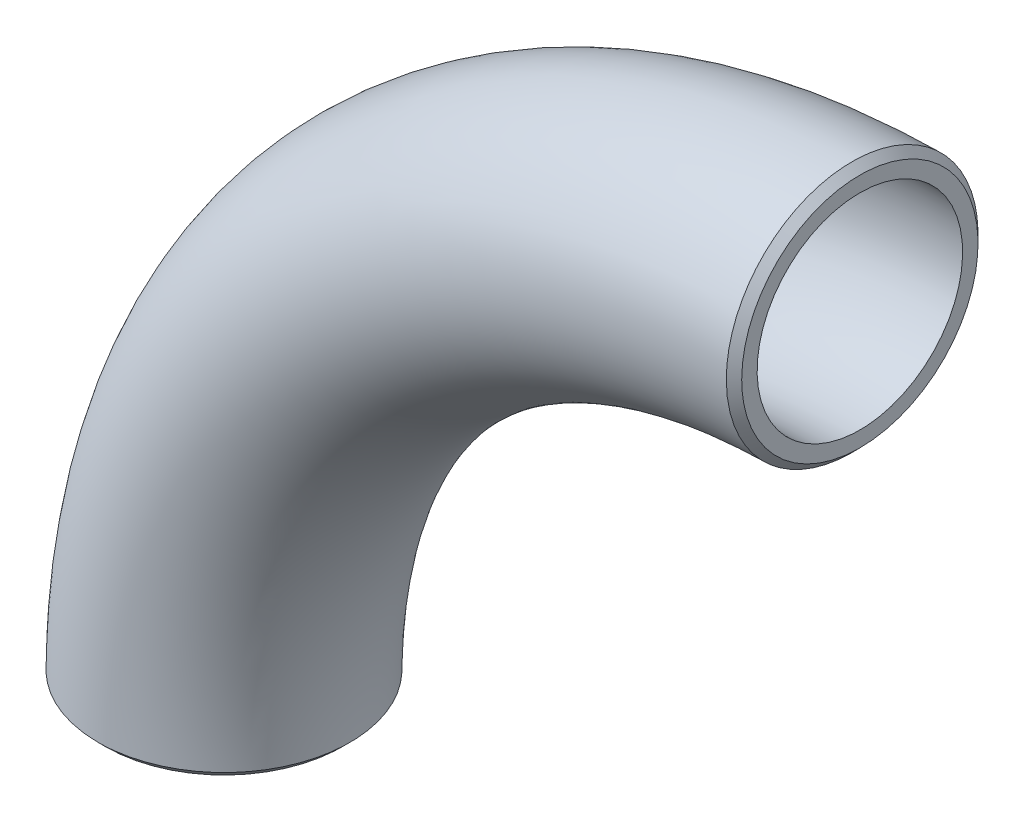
ISO-10303-21;
HEADER;
FILE_DESCRIPTION(('STEP AP214'),'2;1');
FILE_NAME('part.step','',(''),(''),'','','');
FILE_SCHEMA(('AUTOMOTIVE_DESIGN { 1 0 10303 214 1 1 1 1 }'));
ENDSEC;
DATA;
#1=APPLICATION_CONTEXT('core data for automotive mechanical design processes');
#2=APPLICATION_PROTOCOL_DEFINITION('international standard','automotive_design',2000,#1);
#3=PRODUCT_CONTEXT('',#1,'mechanical');
#4=PRODUCT('Part','Part','',(#3));
#5=PRODUCT_RELATED_PRODUCT_CATEGORY('part','',(#4));
#6=PRODUCT_DEFINITION_FORMATION('','',#4);
#7=PRODUCT_DEFINITION_CONTEXT('part definition',#1,'design');
#8=PRODUCT_DEFINITION('design','',#6,#7);
#9=PRODUCT_DEFINITION_SHAPE('','',#8);
#10=(LENGTH_UNIT() NAMED_UNIT(*) SI_UNIT(.MILLI.,.METRE.));
#11=(NAMED_UNIT(*) PLANE_ANGLE_UNIT() SI_UNIT($,.RADIAN.));
#12=(NAMED_UNIT(*) SI_UNIT($,.STERADIAN.) SOLID_ANGLE_UNIT());
#13=UNCERTAINTY_MEASURE_WITH_UNIT(LENGTH_MEASURE(1.E-05),#10,'distance_accuracy_value','');
#14=(GEOMETRIC_REPRESENTATION_CONTEXT(3) GLOBAL_UNCERTAINTY_ASSIGNED_CONTEXT((#13)) GLOBAL_UNIT_ASSIGNED_CONTEXT((#10,
#11,#12)) REPRESENTATION_CONTEXT('',''));
#15=CARTESIAN_POINT('',(0.,0.,0.));
#16=DIRECTION('',(0.,0.,1.));
#17=DIRECTION('',(1.,0.,0.));
#18=AXIS2_PLACEMENT_3D('',#15,#16,#17);
#19=CARTESIAN_POINT('',(0.,0.,0.));
#20=DIRECTION('',(0.,0.,1.));
#21=DIRECTION('',(1.,0.,0.));
#22=AXIS2_PLACEMENT_3D('',#19,#20,#21);
#23=TOROIDAL_SURFACE('',#22,152.4,30.1625);
#24=CARTESIAN_POINT('',(-152.400728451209,1.84574215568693,30.1624976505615));
#25=CARTESIAN_POINT('',(-152.910105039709,1.84611962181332,30.1624587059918));
#26=CARTESIAN_POINT('',(-153.41944974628,1.84649341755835,30.1492429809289));
#27=CARTESIAN_POINT('',(-154.439427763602,1.84723505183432,30.0968505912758));
#28=CARTESIAN_POINT('',(-154.950054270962,1.84760284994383,30.0575410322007));
#29=CARTESIAN_POINT('',(-155.968720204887,1.84833000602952,29.9533614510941));
#30=CARTESIAN_POINT('',(-156.476759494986,1.84868936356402,29.8884900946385));
#31=CARTESIAN_POINT('',(-157.486333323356,1.84939699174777,29.7330906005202));
#32=CARTESIAN_POINT('',(-157.987887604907,1.84974530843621,29.642690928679));
#33=CARTESIAN_POINT('',(-158.983411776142,1.85043057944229,29.4370956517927));
#34=CARTESIAN_POINT('',(-159.477406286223,1.85076757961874,29.322019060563));
#35=CARTESIAN_POINT('',(-160.458732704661,1.85143137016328,29.0673270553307));
#36=CARTESIAN_POINT('',(-160.946068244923,1.85175816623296,28.9277256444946));
#37=CARTESIAN_POINT('',(-161.914209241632,1.85240195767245,28.6236350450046));
#38=CARTESIAN_POINT('',(-162.394996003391,1.85271892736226,28.4590863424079));
#39=CARTESIAN_POINT('',(-163.350190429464,1.85334355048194,28.1051216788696));
#40=CARTESIAN_POINT('',(-163.824551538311,1.85365114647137,27.915580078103));
#41=CARTESIAN_POINT('',(-164.764056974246,1.85425549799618,27.5120408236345));
#42=CARTESIAN_POINT('',(-165.229177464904,1.85455222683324,27.2979876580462));
#43=CARTESIAN_POINT('',(-166.147407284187,1.85513353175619,26.8468151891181));
#44=CARTESIAN_POINT('',(-166.600530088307,1.85541812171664,26.6097232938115));
#45=CARTESIAN_POINT('',(-167.492741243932,1.85597435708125,26.1137841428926));
#46=CARTESIAN_POINT('',(-167.931871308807,1.85624604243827,25.8550119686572));
#47=CARTESIAN_POINT('',(-168.794179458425,1.85677571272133,25.3166643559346));
#48=CARTESIAN_POINT('',(-169.217425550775,1.85703375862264,25.0371978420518));
#49=CARTESIAN_POINT('',(-170.049448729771,1.85753760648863,24.45736205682));
#50=CARTESIAN_POINT('',(-170.458223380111,1.85778340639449,24.1569892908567));
#51=CARTESIAN_POINT('',(-171.261359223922,1.85826321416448,23.5350814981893));
#52=CARTESIAN_POINT('',(-171.655672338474,1.85849718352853,23.2134843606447));
#53=CARTESIAN_POINT('',(-172.429281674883,1.8589533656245,22.54918031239));
#54=CARTESIAN_POINT('',(-172.808499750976,1.85917551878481,22.2063823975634));
#55=CARTESIAN_POINT('',(-173.550643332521,1.85960771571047,21.5004440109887));
#56=CARTESIAN_POINT('',(-173.913491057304,1.8598177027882,21.1372217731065));
#57=CARTESIAN_POINT('',(-174.618343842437,1.86022336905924,20.3947196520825));
#58=CARTESIAN_POINT('',(-174.960448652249,1.86041911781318,20.0155344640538));
#59=CARTESIAN_POINT('',(-175.623258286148,1.86079637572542,19.2421301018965));
#60=CARTESIAN_POINT('',(-175.9440600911,1.86097795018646,18.8479940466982));
#61=CARTESIAN_POINT('',(-176.564524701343,1.8613274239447,18.0451081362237));
#62=CARTESIAN_POINT('',(-176.864241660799,1.86149535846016,17.6364001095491));
#63=CARTESIAN_POINT('',(-177.443162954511,1.86181832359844,16.8041438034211));
#64=CARTESIAN_POINT('',(-177.722348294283,1.86197334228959,16.3805823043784));
#65=CARTESIAN_POINT('',(-178.260279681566,1.86227080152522,15.5171883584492));
#66=CARTESIAN_POINT('',(-178.518895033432,1.8624131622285,15.0772744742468));
#67=CARTESIAN_POINT('',(-179.014465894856,1.86268493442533,14.1836138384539));
#68=CARTESIAN_POINT('',(-179.251350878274,1.8628143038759,13.7298280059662));
#69=CARTESIAN_POINT('',(-179.70176160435,1.86305944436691,12.8109291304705));
#70=CARTESIAN_POINT('',(-179.915292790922,1.86317521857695,12.3458187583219));
#71=CARTESIAN_POINT('',(-180.317423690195,1.8633926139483,11.4069896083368));
#72=CARTESIAN_POINT('',(-180.506113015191,1.86349428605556,10.9333091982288));
#73=CARTESIAN_POINT('',(-180.858688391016,1.86368378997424,9.97910343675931));
#74=CARTESIAN_POINT('',(-181.02267680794,1.86377167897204,9.4986159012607));
#75=CARTESIAN_POINT('',(-181.325848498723,1.8639337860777,8.53059486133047));
#76=CARTESIAN_POINT('',(-181.465065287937,1.86400802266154,8.04307185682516));
#77=CARTESIAN_POINT('',(-181.719077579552,1.86414321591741,7.06085979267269));
#78=CARTESIAN_POINT('',(-181.83383284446,1.86420415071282,6.56616033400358));
#79=CARTESIAN_POINT('',(-182.038719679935,1.86431282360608,5.56918199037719));
#80=CARTESIAN_POINT('',(-182.128729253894,1.86436049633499,5.06687799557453));
#81=CARTESIAN_POINT('',(-182.283208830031,1.8644422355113,4.05641706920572));
#82=CARTESIAN_POINT('',(-182.347580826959,1.86447624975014,3.5482451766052));
#83=CARTESIAN_POINT('',(-182.450706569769,1.86453069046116,2.52972996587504));
#84=CARTESIAN_POINT('',(-182.489481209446,1.86455112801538,2.01938876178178));
#85=CARTESIAN_POINT('',(-182.54071732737,1.86457811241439,1.00016988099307));
#86=CARTESIAN_POINT('',(-182.553321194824,1.86458473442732,0.491299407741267));
#87=CARTESIAN_POINT('',(-182.552625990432,1.86458436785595,-0.523993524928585));
#88=CARTESIAN_POINT('',(-182.539449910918,1.86457744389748,-1.03041610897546));
#89=CARTESIAN_POINT('',(-182.487851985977,1.86455026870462,-2.04239728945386));
#90=CARTESIAN_POINT('',(-182.449409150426,1.86453000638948,-2.54795481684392));
#91=CARTESIAN_POINT('',(-182.346754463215,1.8644758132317,-3.55829805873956));
#92=CARTESIAN_POINT('',(-182.282449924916,1.86444183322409,-4.063074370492));
#93=CARTESIAN_POINT('',(-182.127910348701,1.8643600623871,-5.07192122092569));
#94=CARTESIAN_POINT('',(-182.037513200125,1.86431218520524,-5.57596691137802));
#95=CARTESIAN_POINT('',(-181.831123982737,1.86420271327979,-6.57912668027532));
#96=CARTESIAN_POINT('',(-181.715115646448,1.86414110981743,-7.07823741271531));
#97=CARTESIAN_POINT('',(-181.45829344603,1.8640044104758,-8.0680291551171));
#98=CARTESIAN_POINT('',(-181.317574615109,1.86392936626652,-8.5587348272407));
#99=CARTESIAN_POINT('',(-181.012000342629,1.86376596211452,-9.53065934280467));
#100=CARTESIAN_POINT('',(-180.847232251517,1.86367765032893,-10.0119056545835));
#101=CARTESIAN_POINT('',(-180.494165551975,1.86348785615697,-10.9639654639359));
#102=CARTESIAN_POINT('',(-180.305942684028,1.86338641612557,-11.4348070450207));
#103=CARTESIAN_POINT('',(-179.905528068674,1.86316992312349,-12.3672910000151));
#104=CARTESIAN_POINT('',(-179.693289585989,1.86305484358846,-12.8289133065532));
#105=CARTESIAN_POINT('',(-179.244983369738,1.86281083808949,-13.7425442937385));
#106=CARTESIAN_POINT('',(-179.008830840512,1.86268186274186,-14.1945113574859));
#107=CARTESIAN_POINT('',(-178.513173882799,1.86241002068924,-15.0873751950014));
#108=CARTESIAN_POINT('',(-178.253596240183,1.86226711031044,-15.5282313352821));
#109=CARTESIAN_POINT('',(-177.711721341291,1.861967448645,-16.3970361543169));
#110=CARTESIAN_POINT('',(-177.429377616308,1.86181066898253,-16.8249558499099));
#111=CARTESIAN_POINT('',(-176.844865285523,1.86148452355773,-17.6636885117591));
#112=CARTESIAN_POINT('',(-176.542808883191,1.86131522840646,-18.0745796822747));
#113=CARTESIAN_POINT('',(-175.919647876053,1.86096412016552,-18.8785631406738));
#114=CARTESIAN_POINT('',(-175.5986397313,1.86078236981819,-19.2717301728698));
#115=CARTESIAN_POINT('',(-174.937765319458,1.86040610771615,-20.0406256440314));
#116=CARTESIAN_POINT('',(-174.597934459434,1.86021161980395,-20.4163845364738));
#117=CARTESIAN_POINT('',(-173.899383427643,1.85980953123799,-21.1512368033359));
#118=CARTESIAN_POINT('',(-173.540629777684,1.85960190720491,-21.510298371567));
#119=CARTESIAN_POINT('',(-172.802676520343,1.85917212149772,-22.211835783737));
#120=CARTESIAN_POINT('',(-172.423356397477,1.85894987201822,-22.554184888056));
#121=CARTESIAN_POINT('',(-171.646892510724,1.85849196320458,-23.2203409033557));
#122=CARTESIAN_POINT('',(-171.24970069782,1.8582562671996,-23.544091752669));
#123=CARTESIAN_POINT('',(-170.440291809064,1.85777266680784,-24.1704794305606));
#124=CARTESIAN_POINT('',(-170.028107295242,1.85752478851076,-24.4731582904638));
#125=CARTESIAN_POINT('',(-169.191052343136,1.8570177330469,-25.055115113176));
#126=CARTESIAN_POINT('',(-168.766268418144,1.85675862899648,-25.3345175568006));
#127=CARTESIAN_POINT('',(-167.904487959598,1.85622910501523,-25.8710478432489));
#128=CARTESIAN_POINT('',(-167.467528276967,1.85595871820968,-26.1282349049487));
#129=CARTESIAN_POINT('',(-166.580948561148,1.85540587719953,-26.6202786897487));
#130=CARTESIAN_POINT('',(-166.131322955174,1.85512341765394,-26.8551253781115));
#131=CARTESIAN_POINT('',(-165.219228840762,1.85454588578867,-27.302605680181));
#132=CARTESIAN_POINT('',(-164.756721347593,1.85425077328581,-27.5151597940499));
#133=CARTESIAN_POINT('',(-163.819320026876,1.85364774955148,-27.9176454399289));
#134=CARTESIAN_POINT('',(-163.344377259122,1.85333978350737,-28.1074630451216));
#135=CARTESIAN_POINT('',(-162.384941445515,1.85271232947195,-28.4626961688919));
#136=CARTESIAN_POINT('',(-161.900439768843,1.85239283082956,-28.6280883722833));
#137=CARTESIAN_POINT('',(-160.924632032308,1.85174381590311,-28.9339328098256));
#138=CARTESIAN_POINT('',(-160.433340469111,1.85141431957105,-29.0744313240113));
#139=CARTESIAN_POINT('',(-159.446541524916,1.85074664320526,-29.3297085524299));
#140=CARTESIAN_POINT('',(-158.951064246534,1.85040851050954,-29.4446034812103));
#141=CARTESIAN_POINT('',(-157.956599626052,1.84972362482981,-29.6485344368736));
#142=CARTESIAN_POINT('',(-157.457630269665,1.84937690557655,-29.7376582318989));
#143=CARTESIAN_POINT('',(-156.454710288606,1.84867366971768,-29.8909702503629));
#144=CARTESIAN_POINT('',(-155.950750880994,1.84831713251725,-29.9551009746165));
#145=CARTESIAN_POINT('',(-154.938560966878,1.84759442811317,-30.0580593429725));
#146=CARTESIAN_POINT('',(-154.430321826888,1.84722823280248,-30.0968020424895));
#147=CARTESIAN_POINT('',(-153.410345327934,1.84648657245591,-30.1489803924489));
#148=CARTESIAN_POINT('',(-152.898602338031,1.84611107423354,-30.1623060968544));
#149=CARTESIAN_POINT('',(-151.873878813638,1.84535176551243,-30.1626942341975));
#150=CARTESIAN_POINT('',(-151.360898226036,1.84496793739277,-30.1496942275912));
#151=CARTESIAN_POINT('',(-150.336508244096,1.84419377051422,-30.0970513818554));
#152=CARTESIAN_POINT('',(-149.825098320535,1.84380343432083,-30.0574188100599));
#153=CARTESIAN_POINT('',(-148.805348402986,1.84301762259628,-29.952180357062));
#154=CARTESIAN_POINT('',(-148.297006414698,1.8426221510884,-29.8865937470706));
#155=CARTESIAN_POINT('',(-147.284897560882,1.84182730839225,-29.7298670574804));
#156=CARTESIAN_POINT('',(-146.781125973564,1.84142794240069,-29.6387574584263));
#157=CARTESIAN_POINT('',(-145.779662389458,1.84062658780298,-29.4314704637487));
#158=CARTESIAN_POINT('',(-145.281961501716,1.84022460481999,-29.315336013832));
#159=CARTESIAN_POINT('',(-144.294148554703,1.83941927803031,-29.0584589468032));
#160=CARTESIAN_POINT('',(-143.804021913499,1.83901593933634,-28.9177724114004));
#161=CARTESIAN_POINT('',(-142.832857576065,1.83820919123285,-28.6122811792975));
#162=CARTESIAN_POINT('',(-142.351798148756,1.83780578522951,-28.4475456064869));
#163=CARTESIAN_POINT('',(-141.400160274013,1.83699997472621,-28.0942919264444));
#164=CARTESIAN_POINT('',(-140.929554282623,1.83659757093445,-27.905848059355));
#165=CARTESIAN_POINT('',(-139.997154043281,1.83579271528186,-27.504631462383));
#166=CARTESIAN_POINT('',(-139.535390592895,1.83539026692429,-27.2917871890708));
#167=CARTESIAN_POINT('',(-138.621243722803,1.83458632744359,-26.8421856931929));
#168=CARTESIAN_POINT('',(-138.168908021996,1.83418484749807,-26.6053314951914));
#169=CARTESIAN_POINT('',(-137.275644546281,1.83338494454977,-26.1084730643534));
#170=CARTESIAN_POINT('',(-136.834748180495,1.83298653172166,-25.8484123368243));
#171=CARTESIAN_POINT('',(-135.966698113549,1.83219510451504,-25.3059620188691));
#172=CARTESIAN_POINT('',(-135.539549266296,1.83180209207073,-25.023564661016));
#173=CARTESIAN_POINT('',(-134.702322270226,1.83102514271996,-24.439022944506));
#174=CARTESIAN_POINT('',(-134.292166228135,1.83064116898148,-24.1369901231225));
#175=CARTESIAN_POINT('',(-133.489338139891,1.82988335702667,-23.513734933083));
#176=CARTESIAN_POINT('',(-133.096602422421,1.82950948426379,-23.1925946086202));
#177=CARTESIAN_POINT('',(-132.328266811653,1.82877221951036,-22.5312241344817));
#178=CARTESIAN_POINT('',(-131.952649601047,1.82840881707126,-22.1910140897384));
#179=CARTESIAN_POINT('',(-131.217848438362,1.82769250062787,-21.4914452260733));
#180=CARTESIAN_POINT('',(-130.858708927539,1.82733961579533,-21.1320397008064));
#181=CARTESIAN_POINT('',(-130.157166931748,1.82664514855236,-20.3928649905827));
#182=CARTESIAN_POINT('',(-129.814886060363,1.82630365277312,-20.0129803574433));
#183=CARTESIAN_POINT('',(-129.149104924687,1.82563481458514,-19.2356253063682));
#184=CARTESIAN_POINT('',(-128.825648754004,1.82530750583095,-18.8381171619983));
#185=CARTESIAN_POINT('',(-128.200117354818,1.82467037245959,-18.0284156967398));
#186=CARTESIAN_POINT('',(-127.897983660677,1.82436050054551,-17.6162675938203));
#187=CARTESIAN_POINT('',(-127.317299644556,1.82376117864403,-16.7795581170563));
#188=CARTESIAN_POINT('',(-127.038611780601,1.82347161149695,-16.3550921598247));
#189=CARTESIAN_POINT('',(-126.503218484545,1.82291223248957,-15.4936740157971));
#190=CARTESIAN_POINT('',(-126.246471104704,1.82264238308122,-15.0567478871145));
#191=CARTESIAN_POINT('',(-125.755064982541,1.82212319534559,-14.1698506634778));
#192=CARTESIAN_POINT('',(-125.520437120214,1.8218738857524,-13.7198624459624));
#193=CARTESIAN_POINT('',(-125.073247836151,1.82139644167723,-12.8066089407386));
#194=CARTESIAN_POINT('',(-124.860787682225,1.82116840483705,-12.3432940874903));
#195=CARTESIAN_POINT('',(-124.458576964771,1.82073490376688,-11.4042798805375));
#196=CARTESIAN_POINT('',(-124.268939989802,1.82052955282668,-10.9285318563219));
#197=CARTESIAN_POINT('',(-123.914404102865,1.82014424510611,-9.96836413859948));
#198=CARTESIAN_POINT('',(-123.749484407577,1.81996426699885,-9.48395211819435));
#199=CARTESIAN_POINT('',(-123.44475135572,1.81963061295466,-8.50868509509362));
#200=CARTESIAN_POINT('',(-123.30487359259,1.81947686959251,-8.01785020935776));
#201=CARTESIAN_POINT('',(-123.05074542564,1.81919678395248,-7.03177985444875));
#202=CARTESIAN_POINT('',(-122.936390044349,1.81907032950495,-6.53657145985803));
#203=CARTESIAN_POINT('',(-122.733246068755,1.81884531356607,-5.54225925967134));
#204=CARTESIAN_POINT('',(-122.644392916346,1.81874668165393,-5.04316863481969));
#205=CARTESIAN_POINT('',(-122.491597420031,1.8185768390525,-4.03986475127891));
#206=CARTESIAN_POINT('',(-122.427720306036,1.8185057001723,-3.53564156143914));
#207=CARTESIAN_POINT('',(-122.325356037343,1.81839154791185,-2.52268834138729));
#208=CARTESIAN_POINT('',(-122.286966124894,1.8183486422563,-2.01394847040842));
#209=CARTESIAN_POINT('',(-122.235949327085,1.8182915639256,-0.992631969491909));
#210=CARTESIAN_POINT('',(-122.22345209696,1.81827753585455,-0.480048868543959));
#211=CARTESIAN_POINT('',(-122.224534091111,1.81827874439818,0.544555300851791));
#212=CARTESIAN_POINT('',(-122.238086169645,1.81829395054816,1.05657639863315));
#213=CARTESIAN_POINT('',(-122.291121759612,1.81835327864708,2.07610161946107));
#214=CARTESIAN_POINT('',(-122.330444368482,1.8183972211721,2.5836140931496));
#215=CARTESIAN_POINT('',(-122.434655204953,1.81851341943,3.59411612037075));
#216=CARTESIAN_POINT('',(-122.499448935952,1.81858557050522,4.09711544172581));
#217=CARTESIAN_POINT('',(-122.653919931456,1.81875725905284,5.09868568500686));
#218=CARTESIAN_POINT('',(-122.743568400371,1.81885676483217,5.59726104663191));
#219=CARTESIAN_POINT('',(-122.948610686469,1.81908384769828,6.59164109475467));
#220=CARTESIAN_POINT('',(-123.064128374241,1.81921155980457,7.08742027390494));
#221=CARTESIAN_POINT('',(-123.320758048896,1.81949433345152,8.07491219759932));
#222=CARTESIAN_POINT('',(-123.461993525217,1.81964952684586,8.56659280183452));
#223=CARTESIAN_POINT('',(-123.769155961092,1.81998575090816,9.5427532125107));
#224=CARTESIAN_POINT('',(-123.93510871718,1.82016680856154,10.0272249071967));
#225=CARTESIAN_POINT('',(-124.291218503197,1.82055370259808,10.9856676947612));
#226=CARTESIAN_POINT('',(-124.481307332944,1.82075946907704,11.4596641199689));
#227=CARTESIAN_POINT('',(-124.884257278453,1.82119361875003,12.3952258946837));
#228=CARTESIAN_POINT('',(-125.097007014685,1.82142189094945,12.8568392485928));
#229=CARTESIAN_POINT('',(-125.545018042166,1.8219000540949,13.7676724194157));
#230=CARTESIAN_POINT('',(-125.780225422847,1.82214989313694,14.2169187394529));
#231=CARTESIAN_POINT('',(-126.273245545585,1.82267059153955,15.1032155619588));
#232=CARTESIAN_POINT('',(-126.531073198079,1.82294146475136,15.5402577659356));
#233=CARTESIAN_POINT('',(-127.069204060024,1.82350345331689,16.4025244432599));
#234=CARTESIAN_POINT('',(-127.349586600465,1.82379463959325,16.8276994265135));
#235=CARTESIAN_POINT('',(-127.933187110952,1.82439667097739,17.6650398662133));
#236=CARTESIAN_POINT('',(-128.236505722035,1.82470760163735,18.0771351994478));
#237=CARTESIAN_POINT('',(-128.863856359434,1.8253462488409,18.885871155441));
#238=CARTESIAN_POINT('',(-129.187908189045,1.82567398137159,19.2824964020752));
#239=CARTESIAN_POINT('',(-129.854498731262,1.82634325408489,20.0576211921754));
#240=CARTESIAN_POINT('',(-130.196972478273,1.82668474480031,20.4361765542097));
#241=CARTESIAN_POINT('',(-130.898744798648,1.82737904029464,21.1727210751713));
#242=CARTESIAN_POINT('',(-131.257921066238,1.8277317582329,21.5308267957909));
#243=CARTESIAN_POINT('',(-131.99326309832,1.82844819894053,22.2283626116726));
#244=CARTESIAN_POINT('',(-132.369411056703,1.82881191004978,22.567811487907));
#245=CARTESIAN_POINT('',(-133.139320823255,1.82955026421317,23.2281288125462));
#246=CARTESIAN_POINT('',(-133.533124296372,1.82992493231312,23.548948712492));
#247=CARTESIAN_POINT('',(-134.338572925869,1.83068474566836,24.1718270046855));
#248=CARTESIAN_POINT('',(-134.750300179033,1.83106993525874,24.4737792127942));
#249=CARTESIAN_POINT('',(-135.590635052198,1.83184922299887,25.0579378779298));
#250=CARTESIAN_POINT('',(-136.019317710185,1.83224335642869,25.340036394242));
#251=CARTESIAN_POINT('',(-136.888906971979,1.83303561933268,25.880962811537));
#252=CARTESIAN_POINT('',(-137.329762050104,1.8334337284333,26.1398735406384));
#253=CARTESIAN_POINT('',(-138.222290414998,1.8342324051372,26.6339789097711));
#254=CARTESIAN_POINT('',(-138.673914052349,1.83463295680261,26.8692632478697));
#255=CARTESIAN_POINT('',(-139.586973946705,1.83543533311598,27.3159905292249));
#256=CARTESIAN_POINT('',(-140.048373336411,1.8358371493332,27.5275088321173));
#257=CARTESIAN_POINT('',(-140.980961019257,1.83664166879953,27.9268928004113));
#258=CARTESIAN_POINT('',(-141.452143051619,1.83704437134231,28.1147730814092));
#259=CARTESIAN_POINT('',(-142.405363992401,1.83785135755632,28.4671586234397));
#260=CARTESIAN_POINT('',(-142.887439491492,1.83825564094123,28.6315648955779));
#261=CARTESIAN_POINT('',(-143.860886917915,1.83906432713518,28.9363794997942));
#262=CARTESIAN_POINT('',(-144.35228453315,1.8394687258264,29.0767057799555));
#263=CARTESIAN_POINT('',(-145.34276105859,1.84027606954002,29.3325237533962));
#264=CARTESIAN_POINT('',(-145.841855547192,1.84067900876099,29.4479551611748));
#265=CARTESIAN_POINT('',(-146.844357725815,1.84148052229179,29.6530271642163));
#266=CARTESIAN_POINT('',(-147.347755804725,1.84187910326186,29.742714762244));
#267=CARTESIAN_POINT('',(-148.355525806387,1.84266943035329,29.89599148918));
#268=CARTESIAN_POINT('',(-148.859875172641,1.84306120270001,29.9597288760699));
#269=CARTESIAN_POINT('',(-149.869680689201,1.84383818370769,30.0613645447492));
#270=CARTESIAN_POINT('',(-150.375129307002,1.84422340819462,30.0993377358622));
#271=CARTESIAN_POINT('',(-151.387299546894,1.84498764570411,30.1499084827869));
#272=CARTESIAN_POINT('',(-151.894021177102,1.84536665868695,30.1625058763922));
#273=CARTESIAN_POINT('',(-152.400728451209,1.84574215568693,30.1624976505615));
#274=B_SPLINE_CURVE_WITH_KNOTS('',3,(#24,#25,#26,#27,#28,#29,#30,#31,#32,#33,#34,#35,#36,#37,
#38,#39,#40,#41,#42,#43,#44,#45,#46,#47,#48,#49,#50,#51,#52,#53,#54,#55,#56,#57,#58,#59,#60,#61,
#62,#63,#64,#65,#66,#67,#68,#69,#70,#71,#72,#73,#74,#75,#76,#77,#78,#79,#80,#81,#82,#83,#84,#85,
#86,#87,#88,#89,#90,#91,#92,#93,#94,#95,#96,#97,#98,#99,#100,#101,#102,#103,#104,#105,#106,#107,
#108,#109,#110,#111,#112,#113,#114,#115,#116,#117,#118,#119,#120,#121,#122,#123,#124,#125,#126,
#127,#128,#129,#130,#131,#132,#133,#134,#135,#136,#137,#138,#139,#140,#141,#142,#143,#144,#145,
#146,#147,#148,#149,#150,#151,#152,#153,#154,#155,#156,#157,#158,#159,#160,#161,#162,#163,#164,
#165,#166,#167,#168,#169,#170,#171,#172,#173,#174,#175,#176,#177,#178,#179,#180,#181,#182,#183,
#184,#185,#186,#187,#188,#189,#190,#191,#192,#193,#194,#195,#196,#197,#198,#199,#200,#201,#202,
#203,#204,#205,#206,#207,#208,#209,#210,#211,#212,#213,#214,#215,#216,#217,#218,#219,#220,#221,
#222,#223,#224,#225,#226,#227,#228,#229,#230,#231,#232,#233,#234,#235,#236,#237,#238,#239,#240,
#241,#242,#243,#244,#245,#246,#247,#248,#249,#250,#251,#252,#253,#254,#255,#256,#257,#258,#259,
#260,#261,#262,#263,#264,#265,#266,#267,#268,#269,#270,#271,#272,#273),.UNSPECIFIED.,.F.,.F.,(4,
2,2,2,2,2,2,2,2,2,2,2,2,2,2,2,2,2,2,2,2,2,2,2,2,2,2,2,2,2,2,2,2,2,2,2,2,2,2,2,2,2,2,2,2,2,2,2,2,
2,2,2,2,2,2,2,2,2,2,2,2,2,2,2,2,2,2,2,2,2,2,2,2,2,2,2,2,2,2,2,2,2,2,2,2,2,2,2,2,2,2,2,2,2,2,2,2,
2,2,2,2,2,2,2,2,2,2,2,2,2,2,2,2,2,2,2,2,2,2,2,2,2,2,2,4),(0.,1.52791299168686,3.06366788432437,
4.59950295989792,6.12774293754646,7.64877182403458,9.16893504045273,10.6927835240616,
12.2246073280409,13.7599715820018,15.2935311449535,16.8219834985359,18.3428956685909,
19.8640626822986,21.3898976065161,22.9228106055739,24.4623708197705,25.9938188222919,
27.5177343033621,29.0375809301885,30.5588163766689,32.0890518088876,33.6240898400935,
35.1587692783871,36.6877514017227,38.2102115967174,39.7305960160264,41.2534623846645,
42.7837071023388,44.3197466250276,45.85453080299,47.3809424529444,48.9000895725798,
50.4205003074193,51.9464093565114,53.4820106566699,55.0185901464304,56.5493846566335,
58.0747514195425,59.5953142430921,61.118888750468,62.6480685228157,64.182205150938,
65.7195565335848,67.2488138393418,68.7708653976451,70.2901451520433,71.8122093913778,
73.3444356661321,74.8810613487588,76.4145285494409,77.9391834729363,79.4596399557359,
80.9807761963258,82.5071647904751,84.040907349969,85.5761046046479,87.1084171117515,
88.6336259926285,90.1535776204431,91.6770057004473,93.2055052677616,94.7406017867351,
96.2793435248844,97.8174923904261,99.3545012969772,100.889682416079,102.422249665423,
103.951360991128,105.476160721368,106.996299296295,108.521014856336,110.052154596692,
111.587129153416,113.122639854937,114.650083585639,116.171385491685,117.691112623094,
119.214722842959,120.748068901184,122.284872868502,123.817284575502,125.339967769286,
126.859671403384,128.38146614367,129.909933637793,131.445718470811,132.980204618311,
134.510685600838,136.03475045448,137.554922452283,139.079038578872,140.608936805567,
142.146477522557,143.682416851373,145.208856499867,146.729685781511,148.248760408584,
149.775270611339,151.309313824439,152.844969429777,154.376378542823,155.900580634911,
157.421211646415,158.942852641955,160.470101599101,162.00449145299,163.54036941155,
165.071146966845,166.592084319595,168.111461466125,169.634635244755,171.165726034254,
172.704584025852,174.237705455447,175.764766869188,177.286840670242,178.807968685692,
180.335332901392,181.867802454,183.403942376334,184.9372595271,186.461689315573,
187.981667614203,189.501655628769),.UNSPECIFIED.);
#275=CARTESIAN_POINT('',(-152.400728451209,1.84574215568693,30.1624976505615));
#276=VERTEX_POINT('',#275);
#277=EDGE_CURVE('E51',#276,#276,#274,.F.);
#278=ORIENTED_EDGE('',*,*,#277,.T.);
#279=EDGE_LOOP('',(#278));
#280=FACE_BOUND('',#279,.T.);
#281=CARTESIAN_POINT('',(-1.84574215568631,152.400728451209,30.1624976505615));
#282=CARTESIAN_POINT('',(-1.84428637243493,150.435634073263,30.1642006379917));
#283=CARTESIAN_POINT('',(-1.84274642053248,148.431470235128,29.9673994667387));
#284=CARTESIAN_POINT('',(-1.83966504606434,144.570185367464,29.197202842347));
#285=CARTESIAN_POINT('',(-1.83810916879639,142.691427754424,28.6296087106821));
#286=CARTESIAN_POINT('',(-1.83496364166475,139.028022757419,27.1153333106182));
#287=CARTESIAN_POINT('',(-1.83339172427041,137.265707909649,26.1722080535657));
#288=CARTESIAN_POINT('',(-1.83038519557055,134.003143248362,23.9917852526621));
#289=CARTESIAN_POINT('',(-1.82892582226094,132.474356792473,22.7424302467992));
#290=CARTESIAN_POINT('',(-1.82615736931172,129.655557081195,19.9253952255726));
#291=CARTESIAN_POINT('',(-1.82489060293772,128.407683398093,18.4003467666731));
#292=CARTESIAN_POINT('',(-1.82262803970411,126.224590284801,15.139559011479));
#293=CARTESIAN_POINT('',(-1.82161981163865,125.278126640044,13.373278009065));
#294=CARTESIAN_POINT('',(-1.81998459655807,123.764208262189,9.71690575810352));
#295=CARTESIAN_POINT('',(-1.81935658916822,123.194684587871,7.83900650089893));
#296=CARTESIAN_POINT('',(-1.81849933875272,122.421055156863,3.97272340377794));
#297=CARTESIAN_POINT('',(-1.81827759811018,122.223505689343,1.9703595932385));
#298=CARTESIAN_POINT('',(-1.8182786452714,122.224447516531,-1.95682071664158));
#299=CARTESIAN_POINT('',(-1.81849019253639,122.412868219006,-3.91282363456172));
#300=CARTESIAN_POINT('',(-1.8193474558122,123.186375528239,-7.81599366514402));
#301=CARTESIAN_POINT('',(-1.81998454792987,123.764171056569,-9.71485730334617));
#302=CARTESIAN_POINT('',(-1.82160462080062,125.264053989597,-13.3412442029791));
#303=CARTESIAN_POINT('',(-1.82259972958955,126.197617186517,-15.0951491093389));
#304=CARTESIAN_POINT('',(-1.82488968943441,128.406464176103,-18.402574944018));
#305=CARTESIAN_POINT('',(-1.8261555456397,129.654349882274,-19.9197965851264));
#306=CARTESIAN_POINT('',(-1.8288814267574,132.428510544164,-22.7009530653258));
#307=CARTESIAN_POINT('',(-1.83036716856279,133.983493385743,-23.9791553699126));
#308=CARTESIAN_POINT('',(-1.83338663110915,137.260268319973,-26.1680719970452));
#309=CARTESIAN_POINT('',(-1.83492970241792,138.989804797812,-27.0953781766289));
#310=CARTESIAN_POINT('',(-1.8380716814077,142.646487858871,-28.6150988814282));
#311=CARTESIAN_POINT('',(-1.83965892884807,144.56230334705,-29.1962343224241));
#312=CARTESIAN_POINT('',(-1.84272969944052,148.41073153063,-29.9626649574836));
#313=CARTESIAN_POINT('',(-1.84424232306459,150.37768668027,-30.1594466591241));
#314=CARTESIAN_POINT('',(-1.84866298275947,156.340434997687,-30.1685790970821));
#315=CARTESIAN_POINT('',(-1.85138517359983,160.316944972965,-29.3646866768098));
#316=CARTESIAN_POINT('',(-1.85489555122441,165.752648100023,-27.1121241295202));
#317=CARTESIAN_POINT('',(-1.85599506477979,167.512066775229,-26.1734143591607));
#318=CARTESIAN_POINT('',(-1.85800381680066,170.81190209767,-23.9652130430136));
#319=CARTESIAN_POINT('',(-1.8588991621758,172.327519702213,-22.7174328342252));
#320=CARTESIAN_POINT('',(-1.8605100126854,175.109635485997,-19.9379370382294));
#321=CARTESIAN_POINT('',(-1.86123102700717,176.387111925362,-18.380631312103));
#322=CARTESIAN_POINT('',(-1.86244435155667,178.569744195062,-15.1072141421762));
#323=CARTESIAN_POINT('',(-1.86294942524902,179.496646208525,-13.3769378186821));
#324=CARTESIAN_POINT('',(-1.86376963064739,181.016011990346,-9.71112719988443));
#325=CARTESIAN_POINT('',(-1.86407655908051,181.593145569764,-7.80100567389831));
#326=CARTESIAN_POINT('',(-1.86448146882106,182.356822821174,-3.95174510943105));
#327=CARTESIAN_POINT('',(-1.86458482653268,182.553495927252,-1.98451715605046));
#328=CARTESIAN_POINT('',(-1.86458427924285,182.552457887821,1.9997885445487));
#329=CARTESIAN_POINT('',(-1.86448082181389,182.355607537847,3.95844514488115));
#330=CARTESIAN_POINT('',(-1.86407577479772,181.591661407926,7.80788716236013));
#331=CARTESIAN_POINT('',(-1.8637663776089,181.009939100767,9.72837659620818));
#332=CARTESIAN_POINT('',(-1.86294822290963,179.494466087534,13.3795992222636));
#333=CARTESIAN_POINT('',(-1.86244392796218,178.568910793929,15.1098392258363));
#334=CARTESIAN_POINT('',(-1.86122598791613,176.37811984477,18.3927228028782));
#335=CARTESIAN_POINT('',(-1.86050569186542,175.102083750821,19.9461475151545));
#336=CARTESIAN_POINT('',(-1.85889715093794,172.324134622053,22.7201562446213));
#337=CARTESIAN_POINT('',(-1.85800066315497,170.806480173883,23.970088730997));
#338=CARTESIAN_POINT('',(-1.85598532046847,167.496303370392,26.1827051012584));
#339=CARTESIAN_POINT('',(-1.85489228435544,165.74728710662,27.1143032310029));
#340=CARTESIAN_POINT('',(-1.85255063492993,162.121927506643,28.616742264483));
#341=CARTESIAN_POINT('',(-1.85128393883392,160.218220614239,29.1966424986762));
#342=CARTESIAN_POINT('',(-1.84859372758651,156.320363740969,29.970942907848));
#343=CARTESIAN_POINT('',(-1.84719793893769,154.365822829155,30.1607946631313));
#344=CARTESIAN_POINT('',(-1.84574215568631,152.400728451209,30.1624976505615));
#345=B_SPLINE_CURVE_WITH_KNOTS('',3,(#281,#282,#283,#284,#285,#286,#287,#288,#289,#290,#291,
#292,#293,#294,#295,#296,#297,#298,#299,#300,#301,#302,#303,#304,#305,#306,#307,#308,#309,#310,
#311,#312,#313,#314,#315,#316,#317,#318,#319,#320,#321,#322,#323,#324,#325,#326,#327,#328,#329,
#330,#331,#332,#333,#334,#335,#336,#337,#338,#339,#340,#341,#342,#343,#344),.UNSPECIFIED.,.T.,
.F.,(4,2,2,2,2,2,2,2,2,2,2,2,2,2,2,2,2,2,2,2,2,2,2,2,2,2,2,2,2,2,2,4),(-0.174066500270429,
-0.168533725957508,-0.163000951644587,-0.157468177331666,-0.151935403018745,-0.146402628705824,
-0.140869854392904,-0.135337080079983,-0.129804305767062,-0.124271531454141,-0.11873875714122,
-0.113205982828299,-0.107673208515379,-0.102140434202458,-0.096607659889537,-0.0910748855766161,
-0.0855421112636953,-0.0744765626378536,-0.0689437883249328,-0.063411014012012,
-0.0578782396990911,-0.0523454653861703,-0.0468126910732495,-0.0412799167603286,
-0.0357471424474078,-0.030214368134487,-0.0246815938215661,-0.0191488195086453,
-0.0136160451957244,-0.00808327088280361,-0.00255049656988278,0.00298227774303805),.UNSPECIFIED.);
#346=CARTESIAN_POINT('',(-1.84574215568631,152.400728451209,30.1624976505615));
#347=VERTEX_POINT('',#346);
#348=EDGE_CURVE('E56',#347,#347,#345,.F.);
#349=ORIENTED_EDGE('',*,*,#348,.T.);
#350=EDGE_LOOP('',(#349));
#351=FACE_BOUND('',#350,.T.);
#352=ADVANCED_FACE('F34',(#280,#351),#23,.T.);
#353=CARTESIAN_POINT('',(5.65941353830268E-13,152.4,0.));
#354=DIRECTION('',(1.,0.,0.));
#355=DIRECTION('',(0.,0.,1.));
#356=AXIS2_PLACEMENT_3D('',#353,#354,#355);
#357=PLANE('',#356);
#358=CARTESIAN_POINT('',(6.17569230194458E-13,152.4,28.3167644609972));
#359=CARTESIAN_POINT('',(6.19381205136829E-13,152.875658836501,28.3163963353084));
#360=CARTESIAN_POINT('',(6.21168157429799E-13,153.351321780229,28.3041968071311));
#361=CARTESIAN_POINT('',(6.24708688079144E-13,154.301487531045,28.2559781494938));
#362=CARTESIAN_POINT('',(6.26462262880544E-13,154.775990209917,28.2199564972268));
#363=CARTESIAN_POINT('',(6.29957615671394E-13,155.72399855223,28.1237914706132));
#364=CARTESIAN_POINT('',(6.31699341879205E-13,156.197496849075,28.0635754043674));
#365=CARTESIAN_POINT('',(6.35208535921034E-13,157.143639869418,27.9189029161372));
#366=CARTESIAN_POINT('',(6.36976095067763E-13,157.616262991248,27.8343052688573));
#367=CARTESIAN_POINT('',(6.40493847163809E-13,158.557388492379,27.6410002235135));
#368=CARTESIAN_POINT('',(6.42244005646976E-13,159.025882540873,27.5322522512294));
#369=CARTESIAN_POINT('',(6.4570431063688E-13,159.955527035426,27.2913506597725));
#370=CARTESIAN_POINT('',(6.47414548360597E-13,160.416693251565,27.1592578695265));
#371=CARTESIAN_POINT('',(6.50805231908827E-13,161.330216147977,26.8723971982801));
#372=CARTESIAN_POINT('',(6.52485758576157E-13,161.782597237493,26.7177070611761));
#373=CARTESIAN_POINT('',(6.55834499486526E-13,162.677140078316,26.3862067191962));
#374=CARTESIAN_POINT('',(6.57502736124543E-13,163.119335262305,26.2094867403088));
#375=CARTESIAN_POINT('',(6.60790202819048E-13,163.994598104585,25.8338360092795));
#376=CARTESIAN_POINT('',(6.62409393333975E-13,164.427658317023,25.6348879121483));
#377=CARTESIAN_POINT('',(6.65603474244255E-13,165.284636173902,25.214739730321));
#378=CARTESIAN_POINT('',(6.67178199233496E-13,165.708518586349,24.9934677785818));
#379=CARTESIAN_POINT('',(6.70292972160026E-13,166.54616940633,24.5288516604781));
#380=CARTESIAN_POINT('',(6.71832861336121E-13,166.959892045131,24.2854249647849));
#381=CARTESIAN_POINT('',(6.74893254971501E-13,167.775859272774,23.776927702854));
#382=CARTESIAN_POINT('',(6.76413671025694E-13,168.178057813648,23.5117832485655));
#383=CARTESIAN_POINT('',(6.79383975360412E-13,168.966435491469,22.9627843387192));
#384=CARTESIAN_POINT('',(6.80834183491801E-13,169.352685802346,22.6790320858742));
#385=CARTESIAN_POINT('',(6.83668700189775E-13,170.108284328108,22.0937223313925));
#386=CARTESIAN_POINT('',(6.85053308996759E-13,170.477709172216,21.7922637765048));
#387=CARTESIAN_POINT('',(6.87764596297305E-13,171.19995799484,21.1718055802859));
#388=CARTESIAN_POINT('',(6.89091406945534E-13,171.552820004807,20.8528501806));
#389=CARTESIAN_POINT('',(6.91704404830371E-13,172.242651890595,20.1974238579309));
#390=CARTESIAN_POINT('',(6.9299054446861E-13,172.579603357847,19.8609335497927));
#391=CARTESIAN_POINT('',(6.95452271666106E-13,173.237935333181,19.168849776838));
#392=CARTESIAN_POINT('',(6.96627083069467E-13,173.559199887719,18.8131459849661));
#393=CARTESIAN_POINT('',(6.98903912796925E-13,174.184465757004,18.084856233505));
#394=CARTESIAN_POINT('',(7.00005679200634E-13,174.488406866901,17.7122186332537));
#395=CARTESIAN_POINT('',(7.02156527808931E-13,175.076749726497,16.9524766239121));
#396=CARTESIAN_POINT('',(7.0320566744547E-13,175.3611729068,16.5653888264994));
#397=CARTESIAN_POINT('',(7.0527894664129E-13,175.908331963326,15.7789451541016));
#398=CARTESIAN_POINT('',(7.06303182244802E-13,176.171165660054,15.3796573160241));
#399=CARTESIAN_POINT('',(7.08236110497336E-13,176.675619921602,14.5698734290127));
#400=CARTESIAN_POINT('',(7.09145200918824E-13,176.917312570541,14.159422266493));
#401=CARTESIAN_POINT('',(7.10873943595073E-13,177.379477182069,13.3270149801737));
#402=CARTESIAN_POINT('',(7.11693642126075E-13,177.599960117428,12.9050649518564));
#403=CARTESIAN_POINT('',(7.13251680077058E-13,178.019908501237,12.0495334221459));
#404=CARTESIAN_POINT('',(7.13989811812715E-13,178.219320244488,11.6159255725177));
#405=CARTESIAN_POINT('',(7.15388208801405E-13,178.596958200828,10.7371348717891));
#406=CARTESIAN_POINT('',(7.16048087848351E-13,178.775079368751,10.2919068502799));
#407=CARTESIAN_POINT('',(7.17262105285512E-13,179.108681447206,9.39175698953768));
#408=CARTESIAN_POINT('',(7.17815969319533E-13,179.264103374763,8.93681329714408));
#409=CARTESIAN_POINT('',(7.18839918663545E-13,179.551691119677,8.02021671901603));
#410=CARTESIAN_POINT('',(7.19310100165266E-13,179.683883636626,7.55857220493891));
#411=CARTESIAN_POINT('',(7.20180378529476E-13,179.92401393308,6.63141879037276));
#412=CARTESIAN_POINT('',(7.20580807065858E-13,180.032067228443,6.16593985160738));
#413=CARTESIAN_POINT('',(7.2131638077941E-13,180.22379237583,5.2323004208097));
#414=CARTESIAN_POINT('',(7.21651827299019E-13,180.307577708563,4.76416320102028));
#415=CARTESIAN_POINT('',(7.22229012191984E-13,180.45183952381,3.8237129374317));
#416=CARTESIAN_POINT('',(7.22470632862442E-13,180.512286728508,3.35139540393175));
#417=CARTESIAN_POINT('',(7.22862153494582E-13,180.609355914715,2.4025347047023));
#418=CARTESIAN_POINT('',(7.23011708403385E-13,180.645888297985,1.92598235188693));
#419=CARTESIAN_POINT('',(7.23212818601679E-13,180.694899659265,0.968682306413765));
#420=CARTESIAN_POINT('',(7.23263760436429E-13,180.707228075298,0.487926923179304));
#421=CARTESIAN_POINT('',(7.23263766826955E-13,180.707451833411,-0.474028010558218));
#422=CARTESIAN_POINT('',(7.23212738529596E-13,180.695324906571,-0.955227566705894));
#423=CARTESIAN_POINT('',(7.23011699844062E-13,180.646648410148,-1.91393089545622));
#424=CARTESIAN_POINT('',(7.22862195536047E-13,180.610223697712,-2.39144100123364));
#425=CARTESIAN_POINT('',(7.22470638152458E-13,180.513360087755,-3.34218396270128));
#426=CARTESIAN_POINT('',(7.22228938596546E-13,180.453012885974,-3.81542617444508));
#427=CARTESIAN_POINT('',(7.21652296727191E-13,180.308827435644,-4.75711211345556));
#428=CARTESIAN_POINT('',(7.21317588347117E-13,180.225048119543,-5.22556486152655));
#429=CARTESIAN_POINT('',(7.20580182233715E-13,180.033591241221,-6.15889867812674));
#430=CARTESIAN_POINT('',(7.20177301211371E-13,179.925849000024,-6.62376648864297));
#431=CARTESIAN_POINT('',(7.19301350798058E-13,179.686491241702,-7.54942948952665));
#432=CARTESIAN_POINT('',(7.18827988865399E-13,179.554775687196,-8.01019879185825));
#433=CARTESIAN_POINT('',(7.17799694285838E-13,179.267916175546,-8.92566487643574));
#434=CARTESIAN_POINT('',(7.17244558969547E-13,179.112713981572,-9.3803434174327));
#435=CARTESIAN_POINT('',(7.16038261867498E-13,178.77916060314,-10.2814444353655));
#436=CARTESIAN_POINT('',(7.15387041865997E-13,178.600795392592,-10.7278617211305));
#437=CARTESIAN_POINT('',(7.14003367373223E-13,178.222551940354,-11.6089587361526));
#438=CARTESIAN_POINT('',(7.13271315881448E-13,178.022780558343,-12.0436843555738));
#439=CARTESIAN_POINT('',(7.11719886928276E-13,177.602328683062,-12.9006160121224));
#440=CARTESIAN_POINT('',(7.10900894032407E-13,177.381740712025,-13.3228674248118));
#441=CARTESIAN_POINT('',(7.09169369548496E-13,176.919754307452,-14.1551259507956));
#442=CARTESIAN_POINT('',(7.08256956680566E-13,176.678382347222,-14.5651477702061));
#443=CARTESIAN_POINT('',(7.06311376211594E-13,176.175056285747,-15.3735425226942));
#444=CARTESIAN_POINT('',(7.05277962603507E-13,175.91306062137,-15.7718895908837));
#445=CARTESIAN_POINT('',(7.03183349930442E-13,175.367207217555,-16.5570660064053));
#446=CARTESIAN_POINT('',(7.02122016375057E-13,175.083221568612,-16.9438064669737));
#447=CARTESIAN_POINT('',(6.99952636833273E-13,174.495323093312,-17.7035297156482));
#448=CARTESIAN_POINT('',(6.98844469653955E-13,174.191357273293,-18.0764714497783));
#449=CARTESIAN_POINT('',(6.96566854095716E-13,173.565752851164,-18.805725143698));
#450=CARTESIAN_POINT('',(6.95397555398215E-13,173.244157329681,-19.1620740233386));
#451=CARTESIAN_POINT('',(6.92974875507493E-13,172.585062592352,-19.8554033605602));
#452=CARTESIAN_POINT('',(6.91722081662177E-13,172.247678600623,-20.1924933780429));
#453=CARTESIAN_POINT('',(6.89131839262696E-13,171.557386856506,-20.8486350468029));
#454=CARTESIAN_POINT('',(6.877946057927E-13,171.204519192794,-21.1677288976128));
#455=CARTESIAN_POINT('',(6.85054538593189E-13,170.482703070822,-21.7880577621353));
#456=CARTESIAN_POINT('',(6.83651631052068E-13,170.113736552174,-22.0892717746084));
#457=CARTESIAN_POINT('',(6.80794955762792E-13,169.359478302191,-22.6738522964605));
#458=CARTESIAN_POINT('',(6.79341001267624E-13,168.974125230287,-22.9571396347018));
#459=CARTESIAN_POINT('',(6.76401737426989E-13,168.187539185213,-23.5053680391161));
#460=CARTESIAN_POINT('',(6.74916302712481E-13,167.786232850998,-23.7702038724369));
#461=CARTESIAN_POINT('',(6.71892769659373E-13,166.970820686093,-24.2788329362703));
#462=CARTESIAN_POINT('',(6.70354702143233E-13,166.556722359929,-24.522638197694));
#463=CARTESIAN_POINT('',(6.67245660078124E-13,165.717817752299,-24.9883658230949));
#464=CARTESIAN_POINT('',(6.65674781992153E-13,165.293042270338,-25.2103436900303));
#465=CARTESIAN_POINT('',(6.62514056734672E-13,164.434599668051,-25.6316655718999));
#466=CARTESIAN_POINT('',(6.60924315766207E-13,164.000976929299,-25.8310999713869));
#467=CARTESIAN_POINT('',(6.57724565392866E-13,163.12536422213,-26.2070188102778));
#468=CARTESIAN_POINT('',(6.56114627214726E-13,162.683401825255,-26.3835674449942));
#469=CARTESIAN_POINT('',(6.52818563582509E-13,161.789668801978,-26.7144702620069));
#470=CARTESIAN_POINT('',(6.51132214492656E-13,161.337871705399,-26.8687529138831));
#471=CARTESIAN_POINT('',(6.47710266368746E-13,160.425783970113,-27.1548026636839));
#472=CARTESIAN_POINT('',(6.45974539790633E-13,159.965472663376,-27.2865038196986));
#473=CARTESIAN_POINT('',(6.42464434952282E-13,159.037766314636,-27.5269044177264));
#474=CARTESIAN_POINT('',(6.40689977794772E-13,158.570357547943,-27.6355508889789));
#475=CARTESIAN_POINT('',(6.3711735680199E-13,157.629878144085,-27.8293858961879));
#476=CARTESIAN_POINT('',(6.35319158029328E-13,157.156799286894,-27.9145345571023));
#477=CARTESIAN_POINT('',(6.31713597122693E-13,156.20639983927,-28.0608939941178));
#478=CARTESIAN_POINT('',(6.29906226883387E-13,155.729075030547,-28.1220773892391));
#479=CARTESIAN_POINT('',(6.26294198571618E-13,154.771607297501,-28.2200908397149));
#480=CARTESIAN_POINT('',(6.2448954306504E-13,154.29146272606,-28.2569048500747));
#481=CARTESIAN_POINT('',(6.2090599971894E-13,153.329775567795,-28.3055328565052));
#482=CARTESIAN_POINT('',(6.19127118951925E-13,152.848232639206,-28.3173401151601));
#483=CARTESIAN_POINT('',(6.15580491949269E-13,151.886354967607,-28.316177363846));
#484=CARTESIAN_POINT('',(6.13812729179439E-13,151.406020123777,-28.3032673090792));
#485=CARTESIAN_POINT('',(6.10269427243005E-13,150.448646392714,-28.2534884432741));
#486=CARTESIAN_POINT('',(6.08493953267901E-13,149.971602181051,-28.2167219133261));
#487=CARTESIAN_POINT('',(6.04953044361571E-13,149.021535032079,-28.1192803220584));
#488=CARTESIAN_POINT('',(6.03187595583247E-13,148.548504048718,-28.0586837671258));
#489=CARTESIAN_POINT('',(5.99675001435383E-13,147.607121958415,-27.9139869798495));
#490=CARTESIAN_POINT('',(5.97927824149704E-13,147.138762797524,-27.8299391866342));
#491=CARTESIAN_POINT('',(5.94447539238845E-13,146.205266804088,-27.637715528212));
#492=CARTESIAN_POINT('',(5.92714504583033E-13,145.740147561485,-27.5294541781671));
#493=CARTESIAN_POINT('',(5.8926111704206E-13,144.81380731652,-27.2889970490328));
#494=CARTESIAN_POINT('',(5.87540862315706E-13,144.35261498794,-27.1566909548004));
#495=CARTESIAN_POINT('',(5.84122164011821E-13,143.436656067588,-26.8687750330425));
#496=CARTESIAN_POINT('',(5.82423764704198E-13,142.981902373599,-26.7131241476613));
#497=CARTESIAN_POINT('',(5.79057973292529E-13,142.081508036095,-26.3789076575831));
#498=CARTESIAN_POINT('',(5.7739054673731E-13,141.635857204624,-26.2003695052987));
#499=CARTESIAN_POINT('',(5.74093659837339E-13,140.756286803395,-25.8218601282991));
#500=CARTESIAN_POINT('',(5.72464055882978E-13,140.322321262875,-25.6219956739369));
#501=CARTESIAN_POINT('',(5.69246229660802E-13,139.466472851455,-25.2012579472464));
#502=CARTESIAN_POINT('',(5.67657888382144E-13,139.044554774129,-24.9804563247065));
#503=CARTESIAN_POINT('',(5.64525890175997E-13,138.212573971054,-24.5178515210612));
#504=CARTESIAN_POINT('',(5.62982219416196E-13,137.802507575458,-24.2760549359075));
#505=CARTESIAN_POINT('',(5.59934815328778E-13,136.993747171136,-23.7716348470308));
#506=CARTESIAN_POINT('',(5.58431209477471E-13,136.595089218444,-23.5089535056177));
#507=CARTESIAN_POINT('',(5.55504688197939E-13,135.809583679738,-22.9618942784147));
#508=CARTESIAN_POINT('',(5.54082278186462E-13,135.422815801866,-22.6774019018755));
#509=CARTESIAN_POINT('',(5.51296938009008E-13,134.663390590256,-22.0887186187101));
#510=CARTESIAN_POINT('',(5.49934128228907E-13,134.290762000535,-21.7844906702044));
#511=CARTESIAN_POINT('',(5.47255618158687E-13,133.562367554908,-21.1585575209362));
#512=CARTESIAN_POINT('',(5.45939791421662E-13,133.206555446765,-20.8369061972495));
#513=CARTESIAN_POINT('',(5.43328078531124E-13,132.514360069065,-20.1778179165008));
#514=CARTESIAN_POINT('',(5.42032117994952E-13,132.177863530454,-19.8404998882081));
#515=CARTESIAN_POINT('',(5.39505157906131E-13,131.522642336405,-19.1501425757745));
#516=CARTESIAN_POINT('',(5.38274049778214E-13,131.203887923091,-18.797131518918));
#517=CARTESIAN_POINT('',(5.35889406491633E-13,130.583998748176,-18.0747760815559));
#518=CARTESIAN_POINT('',(5.34736024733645E-13,130.282898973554,-17.7054016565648));
#519=CARTESIAN_POINT('',(5.32522079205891E-13,129.698395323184,-16.9500657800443));
#520=CARTESIAN_POINT('',(5.31461988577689E-13,129.415083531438,-16.5640330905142));
#521=CARTESIAN_POINT('',(5.29451089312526E-13,128.866884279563,-15.776067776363));
#522=CARTESIAN_POINT('',(5.28500887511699E-13,128.602102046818,-15.3740619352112));
#523=CARTESIAN_POINT('',(5.26649536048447E-13,128.094018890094,-14.5579825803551));
#524=CARTESIAN_POINT('',(5.25748278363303E-13,127.850669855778,-14.1439390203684));
#525=CARTESIAN_POINT('',(5.2402383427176E-13,127.386067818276,-13.3054395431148));
#526=CARTESIAN_POINT('',(5.23200397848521E-13,127.16474392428,-12.8810228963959));
#527=CARTESIAN_POINT('',(5.21645098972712E-13,126.7446161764,-12.0230895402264));
#528=CARTESIAN_POINT('',(5.20912915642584E-13,126.545733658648,-11.5896113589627));
#529=CARTESIAN_POINT('',(5.19544452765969E-13,126.170517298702,-10.713932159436));
#530=CARTESIAN_POINT('',(5.1890800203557E-13,125.994143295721,-10.2717483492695));
#531=CARTESIAN_POINT('',(5.17682103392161E-13,125.663350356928,-9.37759531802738));
#532=CARTESIAN_POINT('',(5.17092816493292E-13,125.509005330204,-8.92559875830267));
#533=CARTESIAN_POINT('',(5.15990004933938E-13,125.222821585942,-8.01277794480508));
#534=CARTESIAN_POINT('',(5.15476755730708E-13,125.091064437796,-7.55192811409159));
#535=CARTESIAN_POINT('',(5.14537920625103E-13,124.850690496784,-6.62245268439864));
#536=CARTESIAN_POINT('',(5.14112658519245E-13,124.742159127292,-6.15380498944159));
#537=CARTESIAN_POINT('',(5.13368561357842E-13,124.549180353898,-5.21196251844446));
#538=CARTESIAN_POINT('',(5.13049642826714E-13,124.464714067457,-4.73877161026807));
#539=CARTESIAN_POINT('',(5.12514324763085E-13,124.320415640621,-3.79168025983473));
#540=CARTESIAN_POINT('',(5.12297295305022E-13,124.260432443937,-3.31780284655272));
#541=CARTESIAN_POINT('',(5.11957112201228E-13,124.164826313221,-2.36929144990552));
#542=CARTESIAN_POINT('',(5.11833629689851E-13,124.129118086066,-1.89466605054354));
#543=CARTESIAN_POINT('',(5.11671924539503E-13,124.081437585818,-0.944575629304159));
#544=CARTESIAN_POINT('',(5.11633639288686E-13,124.069447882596,-0.469111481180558));
#545=CARTESIAN_POINT('',(5.11633550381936E-13,124.0695637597,0.484129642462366));
#546=CARTESIAN_POINT('',(5.11672118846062E-13,124.081786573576,0.961906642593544));
#547=CARTESIAN_POINT('',(5.11833876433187E-13,124.130675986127,1.91881868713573));
#548=CARTESIAN_POINT('',(5.11957526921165E-13,124.167475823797,2.39794688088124));
#549=CARTESIAN_POINT('',(5.12296648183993E-13,124.265081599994,3.35410367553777));
#550=CARTESIAN_POINT('',(5.12512185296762E-13,124.325904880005,3.83113050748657));
#551=CARTESIAN_POINT('',(5.13049476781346E-13,124.471701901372,4.77956027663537));
#552=CARTESIAN_POINT('',(5.13370809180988E-13,124.556579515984,5.25097796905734));
#553=CARTESIAN_POINT('',(5.14107927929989E-13,124.74966822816,6.18663442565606));
#554=CARTESIAN_POINT('',(5.14523251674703E-13,124.857764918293,6.65089683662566));
#555=CARTESIAN_POINT('',(5.15438249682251E-13,125.096961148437,7.57272255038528));
#556=CARTESIAN_POINT('',(5.15937797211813E-13,125.228026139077,8.03029481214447));
#557=CARTESIAN_POINT('',(5.17024098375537E-13,125.513394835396,8.93888794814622));
#558=CARTESIAN_POINT('',(5.17610981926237E-13,125.667733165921,9.38989794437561));
#559=CARTESIAN_POINT('',(5.18869263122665E-13,125.999532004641,10.2855939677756));
#560=CARTESIAN_POINT('',(5.19541021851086E-13,126.177091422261,10.7302433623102));
#561=CARTESIAN_POINT('',(5.20974320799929E-13,126.555410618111,11.6114393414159));
#562=CARTESIAN_POINT('',(5.21736172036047E-13,126.756250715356,12.0479514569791));
#563=CARTESIAN_POINT('',(5.233385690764E-13,127.179811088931,12.9102511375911));
#564=CARTESIAN_POINT('',(5.24179119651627E-13,127.402532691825,13.3360380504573));
#565=CARTESIAN_POINT('',(5.25929956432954E-13,127.868426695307,14.1745193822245));
#566=CARTESIAN_POINT('',(5.26840013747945E-13,128.111532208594,14.5872509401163));
#567=CARTESIAN_POINT('',(5.28710812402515E-13,128.617175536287,15.3973201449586));
#568=CARTESIAN_POINT('',(5.29671230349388E-13,128.87959289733,15.794732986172));
#569=CARTESIAN_POINT('',(5.31691680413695E-13,129.423748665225,16.57563388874));
#570=CARTESIAN_POINT('',(5.32751633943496E-13,129.705471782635,16.9591326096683));
#571=CARTESIAN_POINT('',(5.34950267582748E-13,130.288669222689,17.7124927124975));
#572=CARTESIAN_POINT('',(5.36089155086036E-13,130.590195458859,18.0823139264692));
#573=CARTESIAN_POINT('',(5.38428792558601E-13,131.213141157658,18.8079741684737));
#574=CARTESIAN_POINT('',(5.39629819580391E-13,131.534651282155,19.1637353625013));
#575=CARTESIAN_POINT('',(5.42060947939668E-13,132.197012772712,19.8603048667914));
#576=CARTESIAN_POINT('',(5.43291167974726E-13,132.537956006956,20.2010258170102));
#577=CARTESIAN_POINT('',(5.45855194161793E-13,133.235217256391,20.8631587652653));
#578=CARTESIAN_POINT('',(5.47188514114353E-13,133.591459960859,21.1846500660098));
#579=CARTESIAN_POINT('',(5.49917717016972E-13,134.318152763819,21.8076152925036));
#580=CARTESIAN_POINT('',(5.51313278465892E-13,134.688528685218,22.1091757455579));
#581=CARTESIAN_POINT('',(5.54142575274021E-13,135.442896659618,22.6923199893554));
#582=CARTESIAN_POINT('',(5.5557618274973E-13,135.826844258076,22.9739613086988));
#583=CARTESIAN_POINT('',(5.5845506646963E-13,136.608357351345,23.5176562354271));
#584=CARTESIAN_POINT('',(5.59900342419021E-13,137.005922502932,23.7797103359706));
#585=CARTESIAN_POINT('',(5.62888740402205E-13,137.815948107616,24.284503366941));
#586=CARTESIAN_POINT('',(5.64432323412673E-13,138.228474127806,24.5271370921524));
#587=CARTESIAN_POINT('',(5.67579543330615E-13,139.066597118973,24.9921084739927));
#588=CARTESIAN_POINT('',(5.69183362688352E-13,139.492232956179,25.2143760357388));
#589=CARTESIAN_POINT('',(5.72432960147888E-13,140.354659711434,25.6372590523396));
#590=CARTESIAN_POINT('',(5.74078778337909E-13,140.791461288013,25.8378527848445));
#591=CARTESIAN_POINT('',(5.77388660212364E-13,141.673663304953,26.2159261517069));
#592=CARTESIAN_POINT('',(5.79052668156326E-13,142.119039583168,26.3934621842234));
#593=CARTESIAN_POINT('',(5.82408861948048E-13,143.015894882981,26.7249870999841));
#594=CARTESIAN_POINT('',(5.84100861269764E-13,143.467331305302,26.8790912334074));
#595=CARTESIAN_POINT('',(5.87509003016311E-13,144.376408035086,27.1638439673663));
#596=CARTESIAN_POINT('',(5.89225081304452E-13,144.834031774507,27.2945454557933));
#597=CARTESIAN_POINT('',(5.92686594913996E-13,145.755568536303,27.5329457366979));
#598=CARTESIAN_POINT('',(5.94432049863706E-13,146.21948572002,27.6406284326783));
#599=CARTESIAN_POINT('',(5.97942822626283E-13,147.154388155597,27.8329280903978));
#600=CARTESIAN_POINT('',(5.99708195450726E-13,147.625396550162,27.9174327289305));
#601=CARTESIAN_POINT('',(6.03244008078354E-13,148.573405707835,28.0625792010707));
#602=CARTESIAN_POINT('',(6.05014430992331E-13,149.050424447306,28.1231034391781));
#603=CARTESIAN_POINT('',(6.08570467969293E-13,150.006826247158,28.220143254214));
#604=CARTESIAN_POINT('',(6.10356079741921E-13,150.486208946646,28.2566623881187));
#605=CARTESIAN_POINT('',(6.13944708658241E-13,151.443725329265,28.3050805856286));
#606=CARTESIAN_POINT('',(6.15747587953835E-13,151.92185264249,28.317106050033));
#607=CARTESIAN_POINT('',(6.17569230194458E-13,152.4,28.3167644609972));
#608=B_SPLINE_CURVE_WITH_KNOTS('',3,(#358,#359,#360,#361,#362,#363,#364,#365,#366,#367,#368,
#369,#370,#371,#372,#373,#374,#375,#376,#377,#378,#379,#380,#381,#382,#383,#384,#385,#386,#387,
#388,#389,#390,#391,#392,#393,#394,#395,#396,#397,#398,#399,#400,#401,#402,#403,#404,#405,#406,
#407,#408,#409,#410,#411,#412,#413,#414,#415,#416,#417,#418,#419,#420,#421,#422,#423,#424,#425,
#426,#427,#428,#429,#430,#431,#432,#433,#434,#435,#436,#437,#438,#439,#440,#441,#442,#443,#444,
#445,#446,#447,#448,#449,#450,#451,#452,#453,#454,#455,#456,#457,#458,#459,#460,#461,#462,#463,
#464,#465,#466,#467,#468,#469,#470,#471,#472,#473,#474,#475,#476,#477,#478,#479,#480,#481,#482,
#483,#484,#485,#486,#487,#488,#489,#490,#491,#492,#493,#494,#495,#496,#497,#498,#499,#500,#501,
#502,#503,#504,#505,#506,#507,#508,#509,#510,#511,#512,#513,#514,#515,#516,#517,#518,#519,#520,
#521,#522,#523,#524,#525,#526,#527,#528,#529,#530,#531,#532,#533,#534,#535,#536,#537,#538,#539,
#540,#541,#542,#543,#544,#545,#546,#547,#548,#549,#550,#551,#552,#553,#554,#555,#556,#557,#558,
#559,#560,#561,#562,#563,#564,#565,#566,#567,#568,#569,#570,#571,#572,#573,#574,#575,#576,#577,
#578,#579,#580,#581,#582,#583,#584,#585,#586,#587,#588,#589,#590,#591,#592,#593,#594,#595,#596,
#597,#598,#599,#600,#601,#602,#603,#604,#605,#606,#607),.UNSPECIFIED.,.F.,.F.,(4,2,2,2,2,2,2,2,
2,2,2,2,2,2,2,2,2,2,2,2,2,2,2,2,2,2,2,2,2,2,2,2,2,2,2,2,2,2,2,2,2,2,2,2,2,2,2,2,2,2,2,2,2,2,2,2,
2,2,2,2,2,2,2,2,2,2,2,2,2,2,2,2,2,2,2,2,2,2,2,2,2,2,2,2,2,2,2,2,2,2,2,2,2,2,2,2,2,2,2,2,2,2,2,2,
2,2,2,2,2,2,2,2,2,2,2,2,2,2,2,2,2,2,2,2,4),(0.,1.42685093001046,2.85385299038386,
4.28517491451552,5.72496008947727,7.16718275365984,8.60570142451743,10.0393827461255,
11.4673741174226,12.8964876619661,14.3303583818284,15.7698080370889,17.2143764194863,
18.6515852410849,20.0814115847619,21.5077757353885,22.9357516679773,24.3730456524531,
25.815063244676,27.2554712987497,28.6889445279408,30.1173222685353,31.5449570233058,
32.97614688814,34.4141296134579,35.8557848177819,37.2957720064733,38.7287131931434,
40.1548413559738,41.5827528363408,43.0159839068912,44.4581025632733,45.9015349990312,
47.3376067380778,48.768226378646,50.1952798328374,51.6262328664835,53.0632999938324,
54.5039906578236,55.945557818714,57.3802372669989,58.8088161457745,60.2356015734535,
61.6653398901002,63.1041300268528,64.5469036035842,65.9862964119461,67.4164578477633,
68.8431128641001,70.2714117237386,71.7056321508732,73.1474566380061,74.5884507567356,
76.0256804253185,77.4569264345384,78.8840666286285,80.3156941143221,81.7514335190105,
83.1904368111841,84.6318672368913,86.074939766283,87.518961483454,88.9633722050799,
90.4042837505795,91.8390580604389,93.2691446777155,94.6960587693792,96.1280923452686,
97.5668699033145,99.0082082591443,100.447833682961,101.880562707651,103.308554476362,
104.736099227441,106.167745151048,107.607502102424,109.050044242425,110.48835546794,
111.917121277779,113.343413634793,114.772443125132,116.208346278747,117.651834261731,
119.091994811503,120.527358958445,121.957524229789,123.385100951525,124.817360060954,
126.254687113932,127.697213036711,129.138603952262,130.570962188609,131.99826127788,
133.424511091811,134.857683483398,136.298689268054,137.740737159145,139.17710164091,
140.606544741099,142.033855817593,143.463311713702,144.899067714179,146.339933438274,
147.780886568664,149.217283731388,150.645377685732,152.072353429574,153.503232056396,
154.941157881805,156.386559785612,157.825518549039,159.257752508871,160.685665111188,
162.113541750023,163.548692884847,164.988611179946,166.429959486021,167.867713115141,
169.29814892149,170.725310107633,172.153466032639,173.588425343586,175.030336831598,
176.472034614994,177.90627340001),.UNSPECIFIED.);
#609=CARTESIAN_POINT('',(6.17569230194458E-13,152.4,28.3167644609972));
#610=VERTEX_POINT('',#609);
#611=EDGE_CURVE('E10',#610,#610,#608,.F.);
#612=ORIENTED_EDGE('',*,*,#611,.T.);
#613=EDGE_LOOP('',(#612));
#614=FACE_BOUND('',#613,.T.);
#615=CARTESIAN_POINT('',(5.65941353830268E-13,152.4,0.));
#616=DIRECTION('',(1.,0.,0.));
#617=DIRECTION('',(0.,1.,0.));
#618=AXIS2_PLACEMENT_3D('',#615,#616,#617);
#619=CIRCLE('',#618,24.6253);
#620=CARTESIAN_POINT('',(6.57388044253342E-13,177.0253,0.));
#621=VERTEX_POINT('',#620);
#622=EDGE_CURVE('E61',#621,#621,#619,.T.);
#623=ORIENTED_EDGE('',*,*,#622,.F.);
#624=EDGE_LOOP('',(#623));
#625=FACE_BOUND('',#624,.T.);
#626=ADVANCED_FACE('F85',(#614,#625),#357,.T.);
#627=CARTESIAN_POINT('',(-152.4,0.,0.));
#628=DIRECTION('',(0.,1.,0.));
#629=DIRECTION('',(0.,0.,1.));
#630=AXIS2_PLACEMENT_3D('',#627,#628,#629);
#631=PLANE('',#630);
#632=CARTESIAN_POINT('',(-152.4,0.,28.3167644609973));
#633=CARTESIAN_POINT('',(-150.55484860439,0.,28.316623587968));
#634=CARTESIAN_POINT('',(-148.719921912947,0.,28.1397757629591));
#635=CARTESIAN_POINT('',(-145.060808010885,0.,27.4159921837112));
#636=CARTESIAN_POINT('',(-143.272343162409,0.,26.8728318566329));
#637=CARTESIAN_POINT('',(-139.867710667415,0.,25.4649714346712));
#638=CARTESIAN_POINT('',(-138.225651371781,0.,24.5921233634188));
#639=CARTESIAN_POINT('',(-135.115845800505,0.,22.5171889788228));
#640=CARTESIAN_POINT('',(-133.689863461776,0.,21.3446858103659));
#641=CARTESIAN_POINT('',(-131.079964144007,0.,18.7427420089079));
#642=CARTESIAN_POINT('',(-129.881092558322,0.,17.2858094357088));
#643=CARTESIAN_POINT('',(-127.821192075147,0.,14.2046960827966));
#644=CARTESIAN_POINT('',(-126.951053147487,0.,12.5810149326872));
#645=CARTESIAN_POINT('',(-125.525827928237,0.,9.15539412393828));
#646=CARTESIAN_POINT('',(-124.977969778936,0.,7.35226981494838));
#647=CARTESIAN_POINT('',(-124.257815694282,0.,3.73881725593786));
#648=CARTESIAN_POINT('',(-124.071556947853,0.,1.90061435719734));
#649=CARTESIAN_POINT('',(-124.067485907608,0.,-1.83955408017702));
#650=CARTESIAN_POINT('',(-124.250653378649,0.,-3.68726179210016));
#651=CARTESIAN_POINT('',(-124.964804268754,0.,-7.30155793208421));
#652=CARTESIAN_POINT('',(-125.504891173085,0.,-9.09442814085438));
#653=CARTESIAN_POINT('',(-126.928879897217,0.,-12.5379810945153));
#654=CARTESIAN_POINT('',(-127.79792245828,0.,-14.1631065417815));
#655=CARTESIAN_POINT('',(-129.844173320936,0.,-17.2372527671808));
#656=CARTESIAN_POINT('',(-131.042297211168,0.,-18.7002613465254));
#657=CARTESIAN_POINT('',(-133.652579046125,0.,-21.3122374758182));
#658=CARTESIAN_POINT('',(-135.074493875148,0.,-22.4846517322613));
#659=CARTESIAN_POINT('',(-138.169932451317,0.,-24.5597515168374));
#660=CARTESIAN_POINT('',(-139.821678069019,0.,-25.4427502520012));
#661=CARTESIAN_POINT('',(-144.923110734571,0.,-27.5616871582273));
#662=CARTESIAN_POINT('',(-148.654289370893,0.,-28.3193805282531));
#663=CARTESIAN_POINT('',(-154.253308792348,0.,-28.3154596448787));
#664=CARTESIAN_POINT('',(-156.100340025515,0.,-28.1322489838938));
#665=CARTESIAN_POINT('',(-159.713895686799,0.,-27.4156403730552));
#666=CARTESIAN_POINT('',(-161.512183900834,0.,-26.8718317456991));
#667=CARTESIAN_POINT('',(-164.947316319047,0.,-25.447558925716));
#668=CARTESIAN_POINT('',(-166.5717202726,0.,-24.578187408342));
#669=CARTESIAN_POINT('',(-169.648957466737,0.,-22.526210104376));
#670=CARTESIAN_POINT('',(-171.110019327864,0.,-21.3272562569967));
#671=CARTESIAN_POINT('',(-173.71686212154,0.,-18.7180146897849));
#672=CARTESIAN_POINT('',(-174.889351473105,0.,-17.2946807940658));
#673=CARTESIAN_POINT('',(-176.965141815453,0.,-14.1919682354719));
#674=CARTESIAN_POINT('',(-177.843339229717,0.,-12.5454006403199));
#675=CARTESIAN_POINT('',(-179.254065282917,0.,-9.14198247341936));
#676=CARTESIAN_POINT('',(-179.797758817,0.,-7.3605453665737));
#677=CARTESIAN_POINT('',(-180.527070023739,0.,-3.6961410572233));
#678=CARTESIAN_POINT('',(-180.705413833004,0.,-1.85972854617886));
#679=CARTESIAN_POINT('',(-180.709258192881,0.,1.82676150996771));
#680=CARTESIAN_POINT('',(-180.525418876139,0.,3.70635686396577));
#681=CARTESIAN_POINT('',(-179.80194893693,0.,7.33756793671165));
#682=CARTESIAN_POINT('',(-179.268609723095,0.,9.10092403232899));
#683=CARTESIAN_POINT('',(-177.850604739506,0.,12.5337747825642));
#684=CARTESIAN_POINT('',(-176.963124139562,0.,14.1933761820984));
#685=CARTESIAN_POINT('',(-174.916048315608,0.,17.2563471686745));
#686=CARTESIAN_POINT('',(-173.746062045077,0.,18.6886312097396));
#687=CARTESIAN_POINT('',(-171.102051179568,0.,21.3353971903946));
#688=CARTESIAN_POINT('',(-169.667281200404,0.,22.5099283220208));
#689=CARTESIAN_POINT('',(-166.605915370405,0.,24.5593740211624));
#690=CARTESIAN_POINT('',(-164.9529301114,0.,25.4457680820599));
#691=CARTESIAN_POINT('',(-161.513838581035,0.,26.8706102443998));
#692=CARTESIAN_POINT('',(-159.750372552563,0.,27.4047811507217));
#693=CARTESIAN_POINT('',(-156.126691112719,0.,28.1305899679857));
#694=CARTESIAN_POINT('',(-154.24515139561,0.,28.3169053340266));
#695=CARTESIAN_POINT('',(-152.4,0.,28.3167644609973));
#696=B_SPLINE_CURVE_WITH_KNOTS('',3,(#632,#633,#634,#635,#636,#637,#638,#639,#640,#641,#642,
#643,#644,#645,#646,#647,#648,#649,#650,#651,#652,#653,#654,#655,#656,#657,#658,#659,#660,#661,
#662,#663,#664,#665,#666,#667,#668,#669,#670,#671,#672,#673,#674,#675,#676,#677,#678,#679,#680,
#681,#682,#683,#684,#685,#686,#687,#688,#689,#690,#691,#692,#693,#694,#695),.UNSPECIFIED.,.T.,
.F.,(4,2,2,2,2,2,2,2,2,2,2,2,2,2,2,2,2,2,2,2,2,2,2,2,2,2,2,2,2,2,2,4),(0.00293783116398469,
0.0084706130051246,0.0140033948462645,0.0195361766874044,0.0250689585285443,0.0306017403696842,
0.0361345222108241,0.041667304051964,0.0472000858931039,0.0527328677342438,0.0582656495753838,
0.0637984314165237,0.0693312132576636,0.0748639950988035,0.0803967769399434,0.0914623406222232,
0.0969951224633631,0.102527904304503,0.108060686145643,0.113593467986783,0.119126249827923,
0.124659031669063,0.130191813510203,0.135724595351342,0.141257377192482,0.146790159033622,
0.152322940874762,0.157855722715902,0.163388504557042,0.168921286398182,0.174454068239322,
0.179986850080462),.UNSPECIFIED.);
#697=CARTESIAN_POINT('',(-152.4,0.,28.3167644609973));
#698=VERTEX_POINT('',#697);
#699=EDGE_CURVE('E46',#698,#698,#696,.F.);
#700=ORIENTED_EDGE('',*,*,#699,.T.);
#701=EDGE_LOOP('',(#700));
#702=FACE_BOUND('',#701,.T.);
#703=CARTESIAN_POINT('',(-152.4,0.,0.));
#704=DIRECTION('',(0.,1.,0.));
#705=DIRECTION('',(0.,0.,1.));
#706=AXIS2_PLACEMENT_3D('',#703,#704,#705);
#707=CIRCLE('',#706,24.6253);
#708=CARTESIAN_POINT('',(-177.0253,0.,0.));
#709=VERTEX_POINT('',#708);
#710=EDGE_CURVE('E66',#709,#709,#707,.T.);
#711=ORIENTED_EDGE('',*,*,#710,.T.);
#712=EDGE_LOOP('',(#711));
#713=FACE_BOUND('',#712,.T.);
#714=ADVANCED_FACE('F104',(#702,#713),#631,.F.);
#715=CARTESIAN_POINT('',(0.,0.,0.));
#716=DIRECTION('',(0.,0.,1.));
#717=DIRECTION('',(1.,0.,0.));
#718=AXIS2_PLACEMENT_3D('',#715,#716,#717);
#719=TOROIDAL_SURFACE('',#718,152.4,24.6253);
#720=CARTESIAN_POINT('',(0.,0.,0.));
#721=DIRECTION('',(0.,0.,1.));
#722=DIRECTION('',(1.,0.,0.));
#723=AXIS2_PLACEMENT_3D('',#720,#721,#722);
#724=CIRCLE('',#723,177.0253);
#725=EDGE_CURVE('',#621,#709,#724,.T.);
#726=ORIENTED_EDGE('',*,*,#622,.T.);
#727=ORIENTED_EDGE('',*,*,#710,.F.);
#728=ORIENTED_EDGE('',*,*,#725,.T.);
#729=ORIENTED_EDGE('',*,*,#725,.F.);
#730=EDGE_LOOP('',(#726,#728,#727,#729));
#731=FACE_BOUND('',#730,.T.);
#732=ADVANCED_FACE('F113',(#731),#719,.F.);
#733=CARTESIAN_POINT('',(-152.400728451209,1.8457421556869,30.1624976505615));
#734=CARTESIAN_POINT('',(-150.435324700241,1.8442856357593,30.1623475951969));
#735=CARTESIAN_POINT('',(-148.480812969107,1.84278485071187,29.9739725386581));
#736=CARTESIAN_POINT('',(-144.583231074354,1.83967638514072,29.2030115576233));
#737=CARTESIAN_POINT('',(-142.67821135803,1.83809788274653,28.6244471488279));
#738=CARTESIAN_POINT('',(-139.051699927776,1.83498390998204,27.1248200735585));
#739=CARTESIAN_POINT('',(-137.302629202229,1.83342538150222,26.195078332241));
#740=CARTESIAN_POINT('',(-133.990162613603,1.83037359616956,23.9848963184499));
#741=CARTESIAN_POINT('',(-132.471252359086,1.82892225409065,22.7359674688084));
#742=CARTESIAN_POINT('',(-129.691273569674,1.82619296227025,19.9644246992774));
#743=CARTESIAN_POINT('',(-128.414275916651,1.82489765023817,18.4125268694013));
#744=CARTESIAN_POINT('',(-126.220140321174,1.82262321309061,15.1305814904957));
#745=CARTESIAN_POINT('',(-125.293298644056,1.82163595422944,13.4010661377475));
#746=CARTESIAN_POINT('',(-123.775198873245,1.81999670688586,9.75215774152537));
#747=CARTESIAN_POINT('',(-123.191639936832,1.81935323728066,7.8315028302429));
#748=CARTESIAN_POINT('',(-122.424557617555,1.81850319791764,3.98251950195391));
#749=CARTESIAN_POINT('',(-122.226161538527,1.81828056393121,2.02449952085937));
#750=CARTESIAN_POINT('',(-122.221825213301,1.81827571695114,-1.95945923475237));
#751=CARTESIAN_POINT('',(-122.416928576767,1.81849469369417,-3.92760356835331));
#752=CARTESIAN_POINT('',(-123.177616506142,1.81933774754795,-7.77748546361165));
#753=CARTESIAN_POINT('',(-123.752897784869,1.81997231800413,-9.68721789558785));
#754=CARTESIAN_POINT('',(-125.269680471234,1.82161075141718,-13.3552272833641));
#755=CARTESIAN_POINT('',(-126.195354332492,1.82259696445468,-15.0862810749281));
#756=CARTESIAN_POINT('',(-128.374950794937,1.82485743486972,-18.3608051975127));
#757=CARTESIAN_POINT('',(-129.651152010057,1.82615277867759,-19.9191750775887));
#758=CARTESIAN_POINT('',(-132.431538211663,1.82888402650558,-22.701404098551));
#759=CARTESIAN_POINT('',(-133.946115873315,1.83033186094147,-23.9502382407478));
#760=CARTESIAN_POINT('',(-137.243279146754,1.83337182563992,-26.1605964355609));
#761=CARTESIAN_POINT('',(-139.002667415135,1.83494085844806,-27.1011504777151));
#762=CARTESIAN_POINT('',(-144.436558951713,1.83960958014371,-29.3582031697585));
#763=CARTESIAN_POINT('',(-148.410902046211,1.84278643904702,-30.1652842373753));
#764=CARTESIAN_POINT('',(-154.374821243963,1.84720458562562,-30.1611077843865));
#765=CARTESIAN_POINT('',(-156.342228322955,1.84860865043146,-29.9659551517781));
#766=CARTESIAN_POINT('',(-160.191290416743,1.85126551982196,-29.2026368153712));
#767=CARTESIAN_POINT('',(-162.106779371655,1.85254094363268,-28.6233818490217));
#768=CARTESIAN_POINT('',(-165.765792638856,1.85490414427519,-27.1062725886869));
#769=CARTESIAN_POINT('',(-167.496065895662,1.85598486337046,-26.1802340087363));
#770=CARTESIAN_POINT('',(-170.773860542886,1.85798111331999,-23.9945054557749));
#771=CARTESIAN_POINT('',(-172.330146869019,1.85890085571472,-22.7174018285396));
#772=CARTESIAN_POINT('',(-175.106890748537,1.86050825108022,-19.9380856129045));
#773=CARTESIAN_POINT('',(-176.355797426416,1.86121344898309,-18.4219764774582));
#774=CARTESIAN_POINT('',(-178.566878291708,1.86244292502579,-15.1170240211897));
#775=CARTESIAN_POINT('',(-179.502312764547,1.86295246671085,-13.3631304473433));
#776=CARTESIAN_POINT('',(-181.004983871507,1.86376369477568,-9.73787189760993));
#777=CARTESIAN_POINT('',(-181.584113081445,1.86407176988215,-7.84031779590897));
#778=CARTESIAN_POINT('',(-182.360957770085,1.86448366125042,-3.93706159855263));
#779=CARTESIAN_POINT('',(-182.55092530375,1.86458347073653,-1.98094870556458));
#780=CARTESIAN_POINT('',(-182.555020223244,1.86458563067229,1.94583282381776));
#781=CARTESIAN_POINT('',(-182.359199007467,1.86448273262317,3.94794328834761));
#782=CARTESIAN_POINT('',(-181.588576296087,1.86407413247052,7.81584265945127));
#783=CARTESIAN_POINT('',(-181.020476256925,1.86377198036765,9.69413719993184));
#784=CARTESIAN_POINT('',(-179.510051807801,1.8629567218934,13.3507467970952));
#785=CARTESIAN_POINT('',(-178.564729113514,1.8624416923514,15.1185237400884));
#786=CARTESIAN_POINT('',(-176.38423424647,1.86122929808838,18.3811442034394));
#787=CARTESIAN_POINT('',(-175.137993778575,1.86052623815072,19.9067868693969));
#788=CARTESIAN_POINT('',(-172.321659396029,1.85889596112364,22.7260734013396));
#789=CARTESIAN_POINT('',(-170.793378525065,1.85799251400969,23.9771624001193));
#790=CARTESIAN_POINT('',(-167.532489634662,1.85600752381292,26.1601943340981));
#791=CARTESIAN_POINT('',(-165.77177230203,1.85490810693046,27.1043650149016));
#792=CARTESIAN_POINT('',(-162.108541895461,1.85254198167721,28.6220807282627));
#793=CARTESIAN_POINT('',(-160.23014460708,1.85129142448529,29.1910697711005));
#794=CARTESIAN_POINT('',(-156.370296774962,1.8486289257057,29.96418799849));
#795=CARTESIAN_POINT('',(-154.366132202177,1.84719867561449,30.1626477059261));
#796=CARTESIAN_POINT('',(-152.400728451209,1.8457421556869,30.1624976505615));
#797=CARTESIAN_POINT('',(-152.4,0.,28.3167644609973));
#798=CARTESIAN_POINT('',(-150.55484860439,0.,28.316623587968));
#799=CARTESIAN_POINT('',(-148.719921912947,0.,28.1397757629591));
#800=CARTESIAN_POINT('',(-145.060808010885,0.,27.4159921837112));
#801=CARTESIAN_POINT('',(-143.272343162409,0.,26.8728318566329));
#802=CARTESIAN_POINT('',(-139.867710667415,0.,25.4649714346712));
#803=CARTESIAN_POINT('',(-138.225651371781,0.,24.5921233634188));
#804=CARTESIAN_POINT('',(-135.115845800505,0.,22.5171889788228));
#805=CARTESIAN_POINT('',(-133.689863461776,0.,21.3446858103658));
#806=CARTESIAN_POINT('',(-131.079964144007,0.,18.7427420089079));
#807=CARTESIAN_POINT('',(-129.881092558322,0.,17.2858094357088));
#808=CARTESIAN_POINT('',(-127.821192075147,0.,14.2046960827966));
#809=CARTESIAN_POINT('',(-126.951053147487,0.,12.5810149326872));
#810=CARTESIAN_POINT('',(-125.525827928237,0.,9.15539412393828));
#811=CARTESIAN_POINT('',(-124.977969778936,0.,7.35226981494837));
#812=CARTESIAN_POINT('',(-124.257815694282,0.,3.73881725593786));
#813=CARTESIAN_POINT('',(-124.071556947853,0.,1.90061435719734));
#814=CARTESIAN_POINT('',(-124.067485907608,0.,-1.83955408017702));
#815=CARTESIAN_POINT('',(-124.250653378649,0.,-3.68726179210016));
#816=CARTESIAN_POINT('',(-124.964804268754,0.,-7.3015579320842));
#817=CARTESIAN_POINT('',(-125.504891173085,0.,-9.09442814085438));
#818=CARTESIAN_POINT('',(-126.928879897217,0.,-12.5379810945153));
#819=CARTESIAN_POINT('',(-127.79792245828,0.,-14.1631065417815));
#820=CARTESIAN_POINT('',(-129.844173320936,0.,-17.2372527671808));
#821=CARTESIAN_POINT('',(-131.042297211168,0.,-18.7002613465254));
#822=CARTESIAN_POINT('',(-133.652579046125,0.,-21.3122374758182));
#823=CARTESIAN_POINT('',(-135.074493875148,0.,-22.4846517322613));
#824=CARTESIAN_POINT('',(-138.169932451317,0.,-24.5597515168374));
#825=CARTESIAN_POINT('',(-139.821678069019,0.,-25.4427502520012));
#826=CARTESIAN_POINT('',(-144.923110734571,0.,-27.5616871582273));
#827=CARTESIAN_POINT('',(-148.654289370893,0.,-28.3193805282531));
#828=CARTESIAN_POINT('',(-154.253308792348,0.,-28.3154596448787));
#829=CARTESIAN_POINT('',(-156.100340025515,0.,-28.1322489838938));
#830=CARTESIAN_POINT('',(-159.713895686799,0.,-27.4156403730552));
#831=CARTESIAN_POINT('',(-161.512183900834,0.,-26.8718317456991));
#832=CARTESIAN_POINT('',(-164.947316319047,0.,-25.447558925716));
#833=CARTESIAN_POINT('',(-166.5717202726,0.,-24.578187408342));
#834=CARTESIAN_POINT('',(-169.648957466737,0.,-22.526210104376));
#835=CARTESIAN_POINT('',(-171.110019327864,0.,-21.3272562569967));
#836=CARTESIAN_POINT('',(-173.71686212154,0.,-18.7180146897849));
#837=CARTESIAN_POINT('',(-174.889351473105,0.,-17.2946807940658));
#838=CARTESIAN_POINT('',(-176.965141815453,0.,-14.1919682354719));
#839=CARTESIAN_POINT('',(-177.843339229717,0.,-12.5454006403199));
#840=CARTESIAN_POINT('',(-179.254065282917,0.,-9.14198247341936));
#841=CARTESIAN_POINT('',(-179.797758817,0.,-7.3605453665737));
#842=CARTESIAN_POINT('',(-180.527070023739,0.,-3.6961410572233));
#843=CARTESIAN_POINT('',(-180.705413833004,0.,-1.85972854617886));
#844=CARTESIAN_POINT('',(-180.709258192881,0.,1.82676150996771));
#845=CARTESIAN_POINT('',(-180.525418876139,0.,3.70635686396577));
#846=CARTESIAN_POINT('',(-179.80194893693,0.,7.33756793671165));
#847=CARTESIAN_POINT('',(-179.268609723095,0.,9.10092403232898));
#848=CARTESIAN_POINT('',(-177.850604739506,0.,12.5337747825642));
#849=CARTESIAN_POINT('',(-176.963124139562,0.,14.1933761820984));
#850=CARTESIAN_POINT('',(-174.916048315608,0.,17.2563471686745));
#851=CARTESIAN_POINT('',(-173.746062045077,0.,18.6886312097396));
#852=CARTESIAN_POINT('',(-171.102051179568,0.,21.3353971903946));
#853=CARTESIAN_POINT('',(-169.667281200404,0.,22.5099283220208));
#854=CARTESIAN_POINT('',(-166.605915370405,0.,24.5593740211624));
#855=CARTESIAN_POINT('',(-164.9529301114,0.,25.4457680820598));
#856=CARTESIAN_POINT('',(-161.513838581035,0.,26.8706102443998));
#857=CARTESIAN_POINT('',(-159.750372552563,0.,27.4047811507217));
#858=CARTESIAN_POINT('',(-156.126691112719,0.,28.1305899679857));
#859=CARTESIAN_POINT('',(-154.24515139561,0.,28.3169053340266));
#860=CARTESIAN_POINT('',(-152.4,0.,28.3167644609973));
#861=B_SPLINE_SURFACE_WITH_KNOTS('',1,3,((#733,#734,#735,#736,#737,#738,#739,#740,#741,#742,
#743,#744,#745,#746,#747,#748,#749,#750,#751,#752,#753,#754,#755,#756,#757,#758,#759,#760,#761,
#762,#763,#764,#765,#766,#767,#768,#769,#770,#771,#772,#773,#774,#775,#776,#777,#778,#779,#780,
#781,#782,#783,#784,#785,#786,#787,#788,#789,#790,#791,#792,#793,#794,#795,#796),(#797,#798,
#799,#800,#801,#802,#803,#804,#805,#806,#807,#808,#809,#810,#811,#812,#813,#814,#815,#816,#817,
#818,#819,#820,#821,#822,#823,#824,#825,#826,#827,#828,#829,#830,#831,#832,#833,#834,#835,#836,
#837,#838,#839,#840,#841,#842,#843,#844,#845,#846,#847,#848,#849,#850,#851,#852,#853,#854,#855,
#856,#857,#858,#859,#860)),.UNSPECIFIED.,.F.,.T.,.F.,(2,2),(4,2,2,2,2,2,2,2,2,2,2,2,2,2,2,2,2,2,
2,2,2,2,2,2,2,2,2,2,2,2,2,4),(0.,1.),(0.00293783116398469,0.0084706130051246,0.0140033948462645,
0.0195361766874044,0.0250689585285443,0.0306017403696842,0.0361345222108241,0.041667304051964,
0.0472000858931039,0.0527328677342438,0.0582656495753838,0.0637984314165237,0.0693312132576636,
0.0748639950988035,0.0803967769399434,0.0914623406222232,0.0969951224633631,0.102527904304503,
0.108060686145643,0.113593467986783,0.119126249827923,0.124659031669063,0.130191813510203,
0.135724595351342,0.141257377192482,0.146790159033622,0.152322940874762,0.157855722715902,
0.163388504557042,0.168921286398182,0.174454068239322,0.179986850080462),.UNSPECIFIED.);
#862=ORIENTED_EDGE('',*,*,#699,.F.);
#863=EDGE_LOOP('',(#862));
#864=FACE_BOUND('',#863,.T.);
#865=ORIENTED_EDGE('',*,*,#277,.F.);
#866=EDGE_LOOP('',(#865));
#867=FACE_BOUND('',#866,.T.);
#868=ADVANCED_FACE('F88',(#864,#867),#861,.T.);
#869=CARTESIAN_POINT('',(5.65953534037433E-13,152.4,28.3167644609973));
#870=CARTESIAN_POINT('',(5.58963220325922E-13,150.55513905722,28.3183632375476));
#871=CARTESIAN_POINT('',(5.52129711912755E-13,148.673598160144,28.1336049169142));
#872=CARTESIAN_POINT('',(5.38577673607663E-13,145.048560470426,27.4105389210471));
#873=CARTESIAN_POINT('',(5.32010404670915E-13,143.284750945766,26.8776775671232));
#874=CARTESIAN_POINT('',(5.1923202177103E-13,139.845482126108,25.4560651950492));
#875=CARTESIAN_POINT('',(5.1294437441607E-13,138.190988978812,24.5706525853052));
#876=CARTESIAN_POINT('',(5.01868859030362E-13,135.128032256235,22.5236563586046));
#877=CARTESIAN_POINT('',(4.96328732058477E-13,133.692777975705,21.3507531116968));
#878=CARTESIAN_POINT('',(4.86825797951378E-13,131.046432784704,18.7061008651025));
#879=CARTESIAN_POINT('',(4.82296591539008E-13,129.874903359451,17.2743746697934));
#880=CARTESIAN_POINT('',(4.74837086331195E-13,127.825369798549,14.2131242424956));
#881=CARTESIAN_POINT('',(4.71475179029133E-13,126.936809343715,12.5549272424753));
#882=CARTESIAN_POINT('',(4.66142859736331E-13,125.515509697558,9.1222993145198));
#883=CARTESIAN_POINT('',(4.6411954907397E-13,124.980828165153,7.35931431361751));
#884=CARTESIAN_POINT('',(4.61355425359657E-13,124.254527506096,3.7296206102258));
#885=CARTESIAN_POINT('',(4.60785923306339E-13,124.069063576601,1.84978741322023));
#886=CARTESIAN_POINT('',(4.60785923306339E-13,124.06994778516,-1.83707702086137));
#887=CARTESIAN_POINT('',(4.61355425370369E-13,124.24684142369,-3.67338628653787));
#888=CARTESIAN_POINT('',(4.64119549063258E-13,124.973027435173,-7.33770970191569));
#889=CARTESIAN_POINT('',(4.66295004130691E-13,125.51547476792,-9.12037621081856));
#890=CARTESIAN_POINT('',(4.71323034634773E-13,126.923597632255,-12.5248536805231));
#891=CARTESIAN_POINT('',(4.7464449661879E-13,127.800046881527,-14.1714319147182));
#892=CARTESIAN_POINT('',(4.82055500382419E-13,129.873758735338,-17.276466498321));
#893=CARTESIAN_POINT('',(4.86610263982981E-13,131.045299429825,-18.7008448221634));
#894=CARTESIAN_POINT('',(4.96544266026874E-13,133.649736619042,-21.311814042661));
#895=CARTESIAN_POINT('',(5.01663495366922E-13,135.10958459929,-22.5117993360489));
#896=CARTESIAN_POINT('',(5.1314973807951E-13,138.185882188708,-24.5667696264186));
#897=CARTESIAN_POINT('',(5.19237577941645E-13,139.809602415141,-25.437331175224));
#898=CARTESIAN_POINT('',(5.320048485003E-13,143.242560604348,-26.8640556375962));
#899=CARTESIAN_POINT('',(5.38664371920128E-13,145.041160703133,-27.4096296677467));
#900=CARTESIAN_POINT('',(5.5204301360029E-13,148.654128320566,-28.129160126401));
#901=CARTESIAN_POINT('',(5.58926992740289E-13,150.500737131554,-28.3139001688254));
#902=CARTESIAN_POINT('',(5.7935609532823E-13,156.098657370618,-28.3224737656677));
#903=CARTESIAN_POINT('',(5.93973501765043E-13,159.831862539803,-27.5677739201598));
#904=CARTESIAN_POINT('',(6.1244203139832E-13,164.93497604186,-25.4530523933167));
#905=CARTESIAN_POINT('',(6.18567503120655E-13,166.586742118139,-24.5717850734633));
#906=CARTESIAN_POINT('',(6.29999718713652E-13,169.684671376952,-22.4987101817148));
#907=CARTESIAN_POINT('',(6.355012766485E-13,171.10755290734,-21.3272853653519));
#908=CARTESIAN_POINT('',(6.45158329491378E-13,173.719438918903,-18.7178752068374));
#909=CARTESIAN_POINT('',(6.49339236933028E-13,174.918749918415,-17.2558656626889));
#910=CARTESIAN_POINT('',(6.57341221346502E-13,176.967832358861,-14.1827586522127));
#911=CARTESIAN_POINT('',(6.60495963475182E-13,177.838019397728,-12.5583630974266));
#912=CARTESIAN_POINT('',(6.65700133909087E-13,179.264418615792,-9.11687436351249));
#913=CARTESIAN_POINT('',(6.67553150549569E-13,179.806238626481,-7.32363887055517));
#914=CARTESIAN_POINT('',(6.70352330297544E-13,180.523188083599,-3.70992604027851));
#915=CARTESIAN_POINT('',(6.71121144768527E-13,180.707827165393,-1.86307863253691));
#916=CARTESIAN_POINT('',(6.71121144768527E-13,180.706852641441,1.8774155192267));
#917=CARTESIAN_POINT('',(6.70352330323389E-13,180.522047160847,3.71621608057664));
#918=CARTESIAN_POINT('',(6.67553150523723E-13,179.804845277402,7.3300992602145));
#919=CARTESIAN_POINT('',(6.65734023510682E-13,179.258717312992,9.1330682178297));
#920=CARTESIAN_POINT('',(6.60462073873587E-13,177.835972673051,12.5608616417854));
#921=CARTESIAN_POINT('',(6.57307331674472E-13,176.967049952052,14.1852230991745));
#922=CARTESIAN_POINT('',(6.49373126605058E-13,174.91030804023,17.267217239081));
#923=CARTESIAN_POINT('',(6.45273136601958E-13,173.712349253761,18.725583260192));
#924=CARTESIAN_POINT('',(6.35386469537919E-13,171.104374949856,21.3298421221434));
#925=CARTESIAN_POINT('',(6.30128195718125E-13,169.67958120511,22.503287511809));
#926=CARTESIAN_POINT('',(6.18439026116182E-13,166.571943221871,24.5805072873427));
#927=CARTESIAN_POINT('',(6.12458635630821E-13,164.92994307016,25.4550981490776));
#928=CARTESIAN_POINT('',(5.99679393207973E-13,161.526405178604,26.8655984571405));
#929=CARTESIAN_POINT('',(5.93169579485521E-13,159.739178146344,27.4100128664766));
#930=CARTESIAN_POINT('',(5.795034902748E-13,156.079813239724,28.136931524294));
#931=CARTESIAN_POINT('',(5.72943847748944E-13,154.24486094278,28.315165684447));
#932=CARTESIAN_POINT('',(5.65953534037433E-13,152.4,28.3167644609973));
#933=CARTESIAN_POINT('',(-1.84574215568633,152.400728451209,30.1624976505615));
#934=CARTESIAN_POINT('',(-1.84428637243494,150.435634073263,30.1642006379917));
#935=CARTESIAN_POINT('',(-1.8427464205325,148.431470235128,29.9673994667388));
#936=CARTESIAN_POINT('',(-1.83966504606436,144.570185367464,29.197202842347));
#937=CARTESIAN_POINT('',(-1.8381091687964,142.691427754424,28.6296087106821));
#938=CARTESIAN_POINT('',(-1.83496364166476,139.028022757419,27.1153333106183));
#939=CARTESIAN_POINT('',(-1.83339172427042,137.265707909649,26.1722080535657));
#940=CARTESIAN_POINT('',(-1.83038519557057,134.003143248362,23.9917852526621));
#941=CARTESIAN_POINT('',(-1.82892582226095,132.474356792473,22.7424302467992));
#942=CARTESIAN_POINT('',(-1.82615736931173,129.655557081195,19.9253952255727));
#943=CARTESIAN_POINT('',(-1.82489060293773,128.407683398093,18.4003467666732));
#944=CARTESIAN_POINT('',(-1.82262803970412,126.224590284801,15.139559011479));
#945=CARTESIAN_POINT('',(-1.82161981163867,125.278126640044,13.373278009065));
#946=CARTESIAN_POINT('',(-1.81998459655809,123.764208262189,9.71690575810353));
#947=CARTESIAN_POINT('',(-1.81935658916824,123.194684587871,7.83900650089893));
#948=CARTESIAN_POINT('',(-1.81849933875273,122.421055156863,3.97272340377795));
#949=CARTESIAN_POINT('',(-1.8182775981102,122.223505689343,1.9703595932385));
#950=CARTESIAN_POINT('',(-1.81827864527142,122.224447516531,-1.95682071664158));
#951=CARTESIAN_POINT('',(-1.81849019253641,122.412868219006,-3.91282363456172));
#952=CARTESIAN_POINT('',(-1.81934745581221,123.186375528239,-7.81599366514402));
#953=CARTESIAN_POINT('',(-1.81998454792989,123.764171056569,-9.71485730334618));
#954=CARTESIAN_POINT('',(-1.82160462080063,125.264053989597,-13.3412442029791));
#955=CARTESIAN_POINT('',(-1.82259972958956,126.197617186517,-15.0951491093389));
#956=CARTESIAN_POINT('',(-1.82488968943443,128.406464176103,-18.402574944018));
#957=CARTESIAN_POINT('',(-1.82615554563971,129.654349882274,-19.9197965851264));
#958=CARTESIAN_POINT('',(-1.82888142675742,132.428510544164,-22.7009530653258));
#959=CARTESIAN_POINT('',(-1.8303671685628,133.983493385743,-23.9791553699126));
#960=CARTESIAN_POINT('',(-1.83338663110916,137.260268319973,-26.1680719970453));
#961=CARTESIAN_POINT('',(-1.83492970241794,138.989804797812,-27.0953781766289));
#962=CARTESIAN_POINT('',(-1.83807168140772,142.646487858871,-28.6150988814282));
#963=CARTESIAN_POINT('',(-1.83965892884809,144.56230334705,-29.1962343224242));
#964=CARTESIAN_POINT('',(-1.84272969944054,148.41073153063,-29.9626649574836));
#965=CARTESIAN_POINT('',(-1.84424232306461,150.37768668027,-30.1594466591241));
#966=CARTESIAN_POINT('',(-1.84866298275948,156.340434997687,-30.1685790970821));
#967=CARTESIAN_POINT('',(-1.85138517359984,160.316944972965,-29.3646866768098));
#968=CARTESIAN_POINT('',(-1.85489555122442,165.752648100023,-27.1121241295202));
#969=CARTESIAN_POINT('',(-1.8559950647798,167.512066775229,-26.1734143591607));
#970=CARTESIAN_POINT('',(-1.85800381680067,170.81190209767,-23.9652130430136));
#971=CARTESIAN_POINT('',(-1.85889916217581,172.327519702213,-22.7174328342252));
#972=CARTESIAN_POINT('',(-1.86051001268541,175.109635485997,-19.9379370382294));
#973=CARTESIAN_POINT('',(-1.86123102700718,176.387111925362,-18.380631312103));
#974=CARTESIAN_POINT('',(-1.86244435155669,178.569744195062,-15.1072141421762));
#975=CARTESIAN_POINT('',(-1.86294942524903,179.496646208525,-13.3769378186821));
#976=CARTESIAN_POINT('',(-1.8637696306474,181.016011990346,-9.71112719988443));
#977=CARTESIAN_POINT('',(-1.86407655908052,181.593145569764,-7.80100567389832));
#978=CARTESIAN_POINT('',(-1.86448146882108,182.356822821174,-3.95174510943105));
#979=CARTESIAN_POINT('',(-1.86458482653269,182.553495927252,-1.98451715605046));
#980=CARTESIAN_POINT('',(-1.86458427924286,182.552457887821,1.9997885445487));
#981=CARTESIAN_POINT('',(-1.86448082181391,182.355607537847,3.95844514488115));
#982=CARTESIAN_POINT('',(-1.86407577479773,181.591661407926,7.80788716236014));
#983=CARTESIAN_POINT('',(-1.86376637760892,181.009939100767,9.72837659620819));
#984=CARTESIAN_POINT('',(-1.86294822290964,179.494466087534,13.3795992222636));
#985=CARTESIAN_POINT('',(-1.86244392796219,178.568910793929,15.1098392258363));
#986=CARTESIAN_POINT('',(-1.86122598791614,176.37811984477,18.3927228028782));
#987=CARTESIAN_POINT('',(-1.86050569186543,175.102083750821,19.9461475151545));
#988=CARTESIAN_POINT('',(-1.85889715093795,172.324134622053,22.7201562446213));
#989=CARTESIAN_POINT('',(-1.85800066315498,170.806480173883,23.970088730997));
#990=CARTESIAN_POINT('',(-1.85598532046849,167.496303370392,26.1827051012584));
#991=CARTESIAN_POINT('',(-1.85489228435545,165.74728710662,27.1143032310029));
#992=CARTESIAN_POINT('',(-1.85255063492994,162.121927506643,28.616742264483));
#993=CARTESIAN_POINT('',(-1.85128393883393,160.218220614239,29.1966424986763));
#994=CARTESIAN_POINT('',(-1.84859372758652,156.320363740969,29.970942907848));
#995=CARTESIAN_POINT('',(-1.84719793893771,154.365822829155,30.1607946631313));
#996=CARTESIAN_POINT('',(-1.84574215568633,152.400728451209,30.1624976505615));
#997=B_SPLINE_SURFACE_WITH_KNOTS('',1,3,((#869,#870,#871,#872,#873,#874,#875,#876,#877,#878,
#879,#880,#881,#882,#883,#884,#885,#886,#887,#888,#889,#890,#891,#892,#893,#894,#895,#896,#897,
#898,#899,#900,#901,#902,#903,#904,#905,#906,#907,#908,#909,#910,#911,#912,#913,#914,#915,#916,
#917,#918,#919,#920,#921,#922,#923,#924,#925,#926,#927,#928,#929,#930,#931,#932),(#933,#934,
#935,#936,#937,#938,#939,#940,#941,#942,#943,#944,#945,#946,#947,#948,#949,#950,#951,#952,#953,
#954,#955,#956,#957,#958,#959,#960,#961,#962,#963,#964,#965,#966,#967,#968,#969,#970,#971,#972,
#973,#974,#975,#976,#977,#978,#979,#980,#981,#982,#983,#984,#985,#986,#987,#988,#989,#990,#991,
#992,#993,#994,#995,#996)),.UNSPECIFIED.,.F.,.T.,.F.,(2,2),(4,2,2,2,2,2,2,2,2,2,2,2,2,2,2,2,2,2,
2,2,2,2,2,2,2,2,2,2,2,2,2,4),(0.,1.),(-0.174066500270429,-0.168533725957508,-0.163000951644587,
-0.157468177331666,-0.151935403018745,-0.146402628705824,-0.140869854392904,-0.135337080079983,
-0.129804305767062,-0.124271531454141,-0.11873875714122,-0.113205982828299,-0.107673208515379,
-0.102140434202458,-0.096607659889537,-0.0910748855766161,-0.0855421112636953,
-0.0744765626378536,-0.0689437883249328,-0.063411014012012,-0.0578782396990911,
-0.0523454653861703,-0.0468126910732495,-0.0412799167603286,-0.0357471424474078,
-0.030214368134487,-0.0246815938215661,-0.0191488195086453,-0.0136160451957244,
-0.00808327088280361,-0.00255049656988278,0.00298227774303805),.UNSPECIFIED.);
#998=ORIENTED_EDGE('',*,*,#348,.F.);
#999=EDGE_LOOP('',(#998));
#1000=FACE_BOUND('',#999,.T.);
#1001=ORIENTED_EDGE('',*,*,#611,.F.);
#1002=EDGE_LOOP('',(#1001));
#1003=FACE_BOUND('',#1002,.T.);
#1004=ADVANCED_FACE('F36',(#1000,#1003),#997,.T.);
#1005=CLOSED_SHELL('',(#352,#626,#714,#732,#868,#1004));
#1006=MANIFOLD_SOLID_BREP('B2',#1005);
#1007=ADVANCED_BREP_SHAPE_REPRESENTATION('',(#18,#1006),#14);
#1008=SHAPE_DEFINITION_REPRESENTATION(#9,#1007);
ENDSEC;
END-ISO-10303-21;
